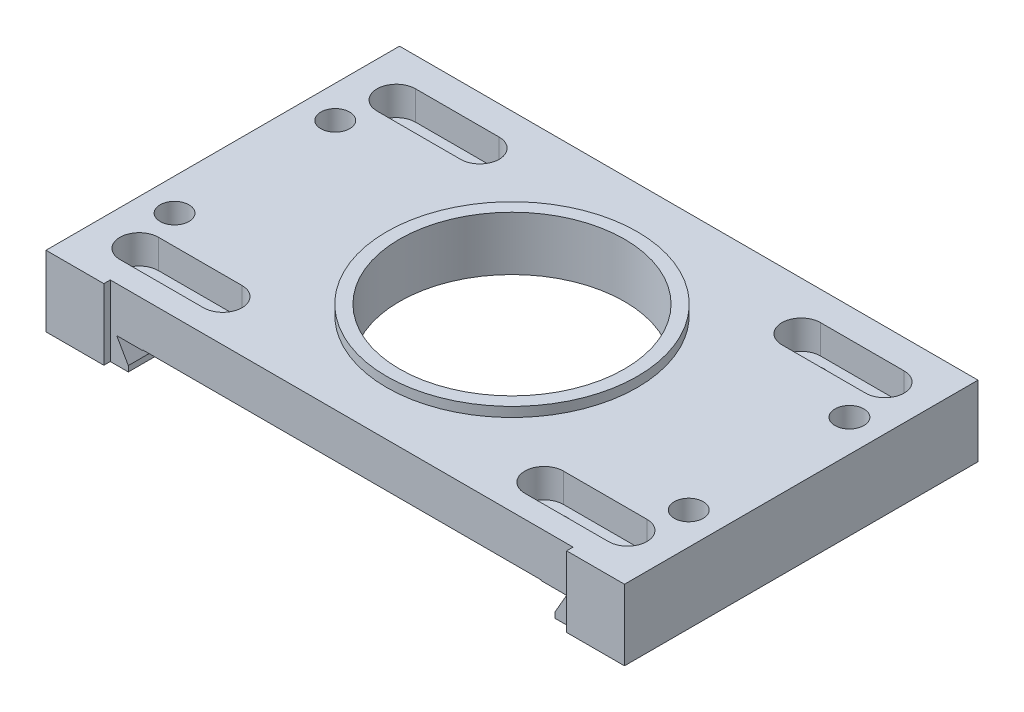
ISO-10303-21;
HEADER;
FILE_DESCRIPTION(('STEP AP214'),'2;1');
FILE_NAME('part.step','',(''),(''),'','','');
FILE_SCHEMA(('AUTOMOTIVE_DESIGN { 1 0 10303 214 1 1 1 1 }'));
ENDSEC;
DATA;
#1=APPLICATION_CONTEXT('core data for automotive mechanical design processes');
#2=APPLICATION_PROTOCOL_DEFINITION('international standard','automotive_design',2000,#1);
#3=PRODUCT_CONTEXT('',#1,'mechanical');
#4=PRODUCT('Part','Part','',(#3));
#5=PRODUCT_RELATED_PRODUCT_CATEGORY('part','',(#4));
#6=PRODUCT_DEFINITION_FORMATION('','',#4);
#7=PRODUCT_DEFINITION_CONTEXT('part definition',#1,'design');
#8=PRODUCT_DEFINITION('design','',#6,#7);
#9=PRODUCT_DEFINITION_SHAPE('','',#8);
#10=(LENGTH_UNIT() NAMED_UNIT(*) SI_UNIT(.MILLI.,.METRE.));
#11=(NAMED_UNIT(*) PLANE_ANGLE_UNIT() SI_UNIT($,.RADIAN.));
#12=(NAMED_UNIT(*) SI_UNIT($,.STERADIAN.) SOLID_ANGLE_UNIT());
#13=UNCERTAINTY_MEASURE_WITH_UNIT(LENGTH_MEASURE(1.E-05),#10,'distance_accuracy_value','');
#14=(GEOMETRIC_REPRESENTATION_CONTEXT(3) GLOBAL_UNCERTAINTY_ASSIGNED_CONTEXT((#13)) GLOBAL_UNIT_ASSIGNED_CONTEXT((#10,
#11,#12)) REPRESENTATION_CONTEXT('',''));
#15=CARTESIAN_POINT('',(0.,0.,0.));
#16=DIRECTION('',(0.,0.,1.));
#17=DIRECTION('',(1.,0.,0.));
#18=AXIS2_PLACEMENT_3D('',#15,#16,#17);
#19=CARTESIAN_POINT('',(35.,-1.5,-27.5));
#20=DIRECTION('',(0.866025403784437,-0.500000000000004,0.));
#21=DIRECTION('',(0.500000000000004,0.866025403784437,0.));
#22=AXIS2_PLACEMENT_3D('',#19,#20,#21);
#23=PLANE('',#22);
#24=DIRECTION('',(0.,0.,1.));
#25=VECTOR('',#24,1.);
#26=CARTESIAN_POINT('',(33.1905989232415,-4.63397459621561,-27.5));
#27=LINE('',#26,#25);
#28=CARTESIAN_POINT('',(33.1905989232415,-4.63397459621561,-27.5));
#29=VERTEX_POINT('',#28);
#30=CARTESIAN_POINT('',(33.1905989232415,-4.63397459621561,-8.49999999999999));
#31=VERTEX_POINT('',#30);
#32=EDGE_CURVE('E377',#29,#31,#27,.T.);
#33=ORIENTED_EDGE('',*,*,#32,.T.);
#34=DIRECTION('',(0.500000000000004,0.866025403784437,0.));
#35=VECTOR('',#34,1.);
#36=CARTESIAN_POINT('',(35.,-1.50000000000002,-8.49999999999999));
#37=LINE('',#36,#35);
#38=CARTESIAN_POINT('',(34.,-3.23205080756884,-8.49999999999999));
#39=VERTEX_POINT('',#38);
#40=EDGE_CURVE('E465',#31,#39,#37,.T.);
#41=ORIENTED_EDGE('',*,*,#40,.T.);
#42=CARTESIAN_POINT('',(34.,-3.23205080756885,-6.49999999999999));
#43=DIRECTION('',(0.866025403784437,-0.500000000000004,0.));
#44=DIRECTION('',(0.500000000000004,0.866025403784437,0.));
#45=AXIS2_PLACEMENT_3D('',#42,#43,#44);
#46=ELLIPSE('',#45,3.99999999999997,2.);
#47=CARTESIAN_POINT('',(35.,-1.5,-8.23205080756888));
#48=VERTEX_POINT('',#47);
#49=EDGE_CURVE('E509',#39,#48,#46,.T.);
#50=ORIENTED_EDGE('',*,*,#49,.T.);
#51=DIRECTION('',(0.,0.,1.));
#52=VECTOR('',#51,1.);
#53=CARTESIAN_POINT('',(35.,-1.5,-27.5));
#54=LINE('',#53,#52);
#55=CARTESIAN_POINT('',(35.,-1.5,-27.5));
#56=VERTEX_POINT('',#55);
#57=EDGE_CURVE('E835',#56,#48,#54,.T.);
#58=ORIENTED_EDGE('',*,*,#57,.F.);
#59=DIRECTION('',(0.500000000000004,0.866025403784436,0.));
#60=VECTOR('',#59,1.);
#61=CARTESIAN_POINT('',(35.,-1.5,-27.5));
#62=LINE('',#61,#60);
#63=EDGE_CURVE('E820',#29,#56,#62,.T.);
#64=ORIENTED_EDGE('',*,*,#63,.F.);
#65=EDGE_LOOP('',(#33,#41,#50,#58,#64));
#66=FACE_BOUND('',#65,.T.);
#67=ADVANCED_FACE('F54',(#66),#23,.F.);
#68=CARTESIAN_POINT('',(45.,-5.5,-27.5));
#69=DIRECTION('',(0.,0.,1.));
#70=DIRECTION('',(1.,0.,0.));
#71=AXIS2_PLACEMENT_3D('',#68,#69,#70);
#72=PLANE('',#71);
#73=DIRECTION('',(0.,-1.,0.));
#74=VECTOR('',#73,1.);
#75=CARTESIAN_POINT('',(33.1905989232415,-4.63397459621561,-27.5));
#76=LINE('',#75,#74);
#77=CARTESIAN_POINT('',(33.1905989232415,-5.5,-27.5));
#78=VERTEX_POINT('',#77);
#79=EDGE_CURVE('E371',#29,#78,#76,.T.);
#80=ORIENTED_EDGE('',*,*,#79,.F.);
#81=ORIENTED_EDGE('',*,*,#63,.T.);
#82=DIRECTION('',(-1.,0.,0.));
#83=VECTOR('',#82,1.);
#84=CARTESIAN_POINT('',(-35.,-1.5,-27.5));
#85=LINE('',#84,#83);
#86=CARTESIAN_POINT('',(31.,-1.5,-27.5));
#87=VERTEX_POINT('',#86);
#88=EDGE_CURVE('E825',#56,#87,#85,.T.);
#89=ORIENTED_EDGE('',*,*,#88,.T.);
#90=DIRECTION('',(0.,-1.,0.));
#91=VECTOR('',#90,1.);
#92=CARTESIAN_POINT('',(31.,-1.4,-27.5));
#93=LINE('',#92,#91);
#94=CARTESIAN_POINT('',(31.,-1.4,-27.5));
#95=VERTEX_POINT('',#94);
#96=EDGE_CURVE('E818',#95,#87,#93,.T.);
#97=ORIENTED_EDGE('',*,*,#96,.F.);
#98=DIRECTION('',(1.,0.,0.));
#99=VECTOR('',#98,1.);
#100=CARTESIAN_POINT('',(-31.,-1.4,-27.5));
#101=LINE('',#100,#99);
#102=CARTESIAN_POINT('',(-31.,-1.4,-27.5));
#103=VERTEX_POINT('',#102);
#104=EDGE_CURVE('E811',#103,#95,#101,.T.);
#105=ORIENTED_EDGE('',*,*,#104,.F.);
#106=DIRECTION('',(0.,-1.,0.));
#107=VECTOR('',#106,1.);
#108=CARTESIAN_POINT('',(-31.,-1.4,-27.5));
#109=LINE('',#108,#107);
#110=CARTESIAN_POINT('',(-31.,-1.5,-27.5));
#111=VERTEX_POINT('',#110);
#112=EDGE_CURVE('E814',#103,#111,#109,.T.);
#113=ORIENTED_EDGE('',*,*,#112,.T.);
#114=CARTESIAN_POINT('',(-35.,-1.5,-27.5));
#115=VERTEX_POINT('',#114);
#116=EDGE_CURVE('E824',#111,#115,#85,.T.);
#117=ORIENTED_EDGE('',*,*,#116,.T.);
#118=DIRECTION('',(0.500000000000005,-0.866025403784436,0.));
#119=VECTOR('',#118,1.);
#120=CARTESIAN_POINT('',(-32.6905989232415,-5.5,-27.5));
#121=LINE('',#120,#119);
#122=CARTESIAN_POINT('',(-33.1905989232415,-4.63397459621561,-27.5));
#123=VERTEX_POINT('',#122);
#124=EDGE_CURVE('E828',#115,#123,#121,.T.);
#125=ORIENTED_EDGE('',*,*,#124,.T.);
#126=DIRECTION('',(0.,-1.,0.));
#127=VECTOR('',#126,1.);
#128=CARTESIAN_POINT('',(-33.1905989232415,-4.63397459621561,-27.5));
#129=LINE('',#128,#127);
#130=CARTESIAN_POINT('',(-33.1905989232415,-5.5,-27.5));
#131=VERTEX_POINT('',#130);
#132=EDGE_CURVE('E858',#123,#131,#129,.T.);
#133=ORIENTED_EDGE('',*,*,#132,.T.);
#134=DIRECTION('',(-1.,0.,0.));
#135=VECTOR('',#134,1.);
#136=CARTESIAN_POINT('',(45.,-5.5,-27.5));
#137=LINE('',#136,#135);
#138=CARTESIAN_POINT('',(-45.,-5.5,-27.5));
#139=VERTEX_POINT('',#138);
#140=EDGE_CURVE('E400',#131,#139,#137,.T.);
#141=ORIENTED_EDGE('',*,*,#140,.T.);
#142=DIRECTION('',(0.,1.,0.));
#143=VECTOR('',#142,1.);
#144=CARTESIAN_POINT('',(-45.,-5.5,-27.5));
#145=LINE('',#144,#143);
#146=CARTESIAN_POINT('',(-45.,5.5,-27.5));
#147=VERTEX_POINT('',#146);
#148=EDGE_CURVE('E833',#139,#147,#145,.T.);
#149=ORIENTED_EDGE('',*,*,#148,.T.);
#150=DIRECTION('',(-1.,0.,0.));
#151=VECTOR('',#150,1.);
#152=CARTESIAN_POINT('',(45.,5.5,-27.5));
#153=LINE('',#152,#151);
#154=CARTESIAN_POINT('',(45.,5.5,-27.5));
#155=VERTEX_POINT('',#154);
#156=EDGE_CURVE('E414',#155,#147,#153,.T.);
#157=ORIENTED_EDGE('',*,*,#156,.F.);
#158=DIRECTION('',(0.,1.,0.));
#159=VECTOR('',#158,1.);
#160=CARTESIAN_POINT('',(45.,-5.5,-27.5));
#161=LINE('',#160,#159);
#162=CARTESIAN_POINT('',(45.,-5.5,-27.5));
#163=VERTEX_POINT('',#162);
#164=EDGE_CURVE('E398',#163,#155,#161,.T.);
#165=ORIENTED_EDGE('',*,*,#164,.F.);
#166=EDGE_CURVE('E389',#163,#78,#137,.T.);
#167=ORIENTED_EDGE('',*,*,#166,.T.);
#168=EDGE_LOOP('',(#80,#81,#89,#97,#105,#113,#117,#125,#133,#141,#149,#157,#165,#167));
#169=FACE_BOUND('',#168,.T.);
#170=ADVANCED_FACE('F395',(#169),#72,.F.);
#171=CARTESIAN_POINT('',(45.,-5.5,27.5));
#172=DIRECTION('',(0.,1.,0.));
#173=DIRECTION('',(0.,0.,1.));
#174=AXIS2_PLACEMENT_3D('',#171,#172,#173);
#175=PLANE('',#174);
#176=CARTESIAN_POINT('',(40.,-5.5,12.5));
#177=DIRECTION('',(0.,-1.,0.));
#178=DIRECTION('',(0.,0.,-1.));
#179=AXIS2_PLACEMENT_3D('',#176,#177,#178);
#180=CIRCLE('',#179,4.);
#181=CARTESIAN_POINT('',(40.,-5.5,8.5));
#182=VERTEX_POINT('',#181);
#183=EDGE_CURVE('E454',#182,#182,#180,.T.);
#184=ORIENTED_EDGE('',*,*,#183,.F.);
#185=EDGE_LOOP('',(#184));
#186=FACE_BOUND('',#185,.T.);
#187=CARTESIAN_POINT('',(40.,-5.5,-12.5));
#188=DIRECTION('',(0.,-1.,0.));
#189=DIRECTION('',(0.,0.,-1.));
#190=AXIS2_PLACEMENT_3D('',#187,#188,#189);
#191=CIRCLE('',#190,4.);
#192=CARTESIAN_POINT('',(40.,-5.5,-16.5));
#193=VERTEX_POINT('',#192);
#194=EDGE_CURVE('E449',#193,#193,#191,.T.);
#195=ORIENTED_EDGE('',*,*,#194,.F.);
#196=EDGE_LOOP('',(#195));
#197=FACE_BOUND('',#196,.T.);
#198=DIRECTION('',(0.,0.,1.));
#199=VECTOR('',#198,1.);
#200=CARTESIAN_POINT('',(33.1905989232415,-5.5,-27.5));
#201=LINE('',#200,#199);
#202=CARTESIAN_POINT('',(33.1905989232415,-5.5,-8.49999999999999));
#203=VERTEX_POINT('',#202);
#204=EDGE_CURVE('E374',#78,#203,#201,.T.);
#205=ORIENTED_EDGE('',*,*,#204,.F.);
#206=ORIENTED_EDGE('',*,*,#166,.F.);
#207=DIRECTION('',(0.,0.,-1.));
#208=VECTOR('',#207,1.);
#209=CARTESIAN_POINT('',(45.,-5.5,27.5));
#210=LINE('',#209,#208);
#211=CARTESIAN_POINT('',(45.,-5.5,27.5));
#212=VERTEX_POINT('',#211);
#213=EDGE_CURVE('E404',#212,#163,#210,.T.);
#214=ORIENTED_EDGE('',*,*,#213,.F.);
#215=DIRECTION('',(-1.,0.,0.));
#216=VECTOR('',#215,1.);
#217=CARTESIAN_POINT('',(45.,-5.5,27.5));
#218=LINE('',#217,#216);
#219=CARTESIAN_POINT('',(36.,-5.5,27.5));
#220=VERTEX_POINT('',#219);
#221=EDGE_CURVE('E402',#212,#220,#218,.T.);
#222=ORIENTED_EDGE('',*,*,#221,.T.);
#223=DIRECTION('',(0.,0.,1.));
#224=VECTOR('',#223,1.);
#225=CARTESIAN_POINT('',(36.,-5.5,26.5));
#226=LINE('',#225,#224);
#227=CARTESIAN_POINT('',(36.,-5.5,26.5));
#228=VERTEX_POINT('',#227);
#229=EDGE_CURVE('E581',#228,#220,#226,.T.);
#230=ORIENTED_EDGE('',*,*,#229,.F.);
#231=DIRECTION('',(1.,0.,0.));
#232=VECTOR('',#231,1.);
#233=CARTESIAN_POINT('',(-36.,-5.5,26.5));
#234=LINE('',#233,#232);
#235=CARTESIAN_POINT('',(33.1905989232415,-5.5,26.5));
#236=VERTEX_POINT('',#235);
#237=EDGE_CURVE('E561',#236,#228,#234,.T.);
#238=ORIENTED_EDGE('',*,*,#237,.F.);
#239=CARTESIAN_POINT('',(33.1905989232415,-5.5,7.50000000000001));
#240=VERTEX_POINT('',#239);
#241=EDGE_CURVE('E381',#240,#236,#201,.T.);
#242=ORIENTED_EDGE('',*,*,#241,.F.);
#243=DIRECTION('',(-1.,0.,0.));
#244=VECTOR('',#243,1.);
#245=CARTESIAN_POINT('',(32.6905989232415,-5.5,7.50000000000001));
#246=LINE('',#245,#244);
#247=CARTESIAN_POINT('',(34.,-5.5,7.50000000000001));
#248=VERTEX_POINT('',#247);
#249=EDGE_CURVE('E875',#248,#240,#246,.T.);
#250=ORIENTED_EDGE('',*,*,#249,.F.);
#251=CARTESIAN_POINT('',(34.,-5.5,5.50000000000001));
#252=DIRECTION('',(0.,1.,0.));
#253=DIRECTION('',(0.,0.,1.));
#254=AXIS2_PLACEMENT_3D('',#251,#252,#253);
#255=CIRCLE('',#254,2.);
#256=CARTESIAN_POINT('',(36.,-5.5,5.50000000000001));
#257=VERTEX_POINT('',#256);
#258=EDGE_CURVE('E503',#248,#257,#255,.T.);
#259=ORIENTED_EDGE('',*,*,#258,.T.);
#260=DIRECTION('',(0.,0.,1.));
#261=VECTOR('',#260,1.);
#262=CARTESIAN_POINT('',(36.,-5.5,7.50000000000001));
#263=LINE('',#262,#261);
#264=CARTESIAN_POINT('',(36.,-5.5,-6.49999999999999));
#265=VERTEX_POINT('',#264);
#266=EDGE_CURVE('E877',#265,#257,#263,.T.);
#267=ORIENTED_EDGE('',*,*,#266,.F.);
#268=CARTESIAN_POINT('',(34.,-5.5,-6.49999999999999));
#269=DIRECTION('',(0.,1.,0.));
#270=DIRECTION('',(0.,0.,1.));
#271=AXIS2_PLACEMENT_3D('',#268,#269,#270);
#272=CIRCLE('',#271,2.);
#273=CARTESIAN_POINT('',(34.,-5.5,-8.49999999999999));
#274=VERTEX_POINT('',#273);
#275=EDGE_CURVE('E507',#265,#274,#272,.T.);
#276=ORIENTED_EDGE('',*,*,#275,.T.);
#277=DIRECTION('',(1.,0.,0.));
#278=VECTOR('',#277,1.);
#279=CARTESIAN_POINT('',(32.6905989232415,-5.5,-8.49999999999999));
#280=LINE('',#279,#278);
#281=EDGE_CURVE('E392',#203,#274,#280,.T.);
#282=ORIENTED_EDGE('',*,*,#281,.F.);
#283=EDGE_LOOP('',(#205,#206,#214,#222,#230,#238,#242,#250,#259,#267,#276,#282));
#284=FACE_BOUND('',#283,.T.);
#285=ADVANCED_FACE('F387',(#186,#197,#284),#175,.F.);
#286=CARTESIAN_POINT('',(33.1905989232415,-4.63397459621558,7.49999999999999));
#287=VERTEX_POINT('',#286);
#288=CARTESIAN_POINT('',(33.1905989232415,-4.63397459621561,26.5));
#289=VERTEX_POINT('',#288);
#290=EDGE_CURVE('E393',#287,#289,#27,.T.);
#291=ORIENTED_EDGE('',*,*,#290,.T.);
#292=DIRECTION('',(0.500000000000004,0.866025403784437,0.));
#293=VECTOR('',#292,1.);
#294=CARTESIAN_POINT('',(35.,-1.5,26.5));
#295=LINE('',#294,#293);
#296=CARTESIAN_POINT('',(35.,-1.5,26.5));
#297=VERTEX_POINT('',#296);
#298=EDGE_CURVE('E599',#289,#297,#295,.T.);
#299=ORIENTED_EDGE('',*,*,#298,.T.);
#300=CARTESIAN_POINT('',(35.,-1.5,7.23205080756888));
#301=VERTEX_POINT('',#300);
#302=EDGE_CURVE('E831',#301,#297,#54,.T.);
#303=ORIENTED_EDGE('',*,*,#302,.F.);
#304=CARTESIAN_POINT('',(34.,-3.23205080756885,5.50000000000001));
#305=DIRECTION('',(0.866025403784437,-0.500000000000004,0.));
#306=DIRECTION('',(0.500000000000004,0.866025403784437,0.));
#307=AXIS2_PLACEMENT_3D('',#304,#305,#306);
#308=ELLIPSE('',#307,3.99999999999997,2.);
#309=CARTESIAN_POINT('',(34.,-3.23205080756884,7.49999999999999));
#310=VERTEX_POINT('',#309);
#311=EDGE_CURVE('E505',#301,#310,#308,.T.);
#312=ORIENTED_EDGE('',*,*,#311,.T.);
#313=DIRECTION('',(-0.500000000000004,-0.866025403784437,0.));
#314=VECTOR('',#313,1.);
#315=CARTESIAN_POINT('',(35.,-1.50000000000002,7.50000000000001));
#316=LINE('',#315,#314);
#317=EDGE_CURVE('E463',#310,#287,#316,.T.);
#318=ORIENTED_EDGE('',*,*,#317,.T.);
#319=EDGE_LOOP('',(#291,#299,#303,#312,#318));
#320=FACE_BOUND('',#319,.T.);
#321=ADVANCED_FACE('F897',(#320),#23,.F.);
#322=CARTESIAN_POINT('',(0.,0.,26.5));
#323=DIRECTION('',(0.,0.,-1.));
#324=DIRECTION('',(-1.,0.,0.));
#325=AXIS2_PLACEMENT_3D('',#322,#323,#324);
#326=PLANE('',#325);
#327=DIRECTION('',(0.,-1.,0.));
#328=VECTOR('',#327,1.);
#329=CARTESIAN_POINT('',(33.1905989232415,-4.63397459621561,26.5));
#330=LINE('',#329,#328);
#331=EDGE_CURVE('E382',#289,#236,#330,.T.);
#332=ORIENTED_EDGE('',*,*,#331,.T.);
#333=ORIENTED_EDGE('',*,*,#237,.T.);
#334=DIRECTION('',(0.,1.,0.));
#335=VECTOR('',#334,1.);
#336=CARTESIAN_POINT('',(36.,-5.5,26.5));
#337=LINE('',#336,#335);
#338=CARTESIAN_POINT('',(36.,5.5,26.5));
#339=VERTEX_POINT('',#338);
#340=EDGE_CURVE('E566',#228,#339,#337,.T.);
#341=ORIENTED_EDGE('',*,*,#340,.T.);
#342=DIRECTION('',(-1.,0.,0.));
#343=VECTOR('',#342,1.);
#344=CARTESIAN_POINT('',(-36.,5.5,26.5));
#345=LINE('',#344,#343);
#346=CARTESIAN_POINT('',(-36.,5.5,26.5));
#347=VERTEX_POINT('',#346);
#348=EDGE_CURVE('E569',#339,#347,#345,.T.);
#349=ORIENTED_EDGE('',*,*,#348,.T.);
#350=DIRECTION('',(0.,-1.,0.));
#351=VECTOR('',#350,1.);
#352=CARTESIAN_POINT('',(-36.,-5.5,26.5));
#353=LINE('',#352,#351);
#354=CARTESIAN_POINT('',(-36.,-5.5,26.5));
#355=VERTEX_POINT('',#354);
#356=EDGE_CURVE('E558',#347,#355,#353,.T.);
#357=ORIENTED_EDGE('',*,*,#356,.T.);
#358=CARTESIAN_POINT('',(-33.1905989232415,-5.5,26.5));
#359=VERTEX_POINT('',#358);
#360=EDGE_CURVE('E563',#355,#359,#234,.T.);
#361=ORIENTED_EDGE('',*,*,#360,.T.);
#362=DIRECTION('',(0.,-1.,0.));
#363=VECTOR('',#362,1.);
#364=CARTESIAN_POINT('',(-33.1905989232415,-4.63397459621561,26.5));
#365=LINE('',#364,#363);
#366=CARTESIAN_POINT('',(-33.1905989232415,-4.63397459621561,26.5));
#367=VERTEX_POINT('',#366);
#368=EDGE_CURVE('E861',#367,#359,#365,.T.);
#369=ORIENTED_EDGE('',*,*,#368,.F.);
#370=DIRECTION('',(0.500000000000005,-0.866025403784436,0.));
#371=VECTOR('',#370,1.);
#372=CARTESIAN_POINT('',(-32.6905989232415,-5.5,26.5));
#373=LINE('',#372,#371);
#374=CARTESIAN_POINT('',(-35.,-1.5,26.5));
#375=VERTEX_POINT('',#374);
#376=EDGE_CURVE('E593',#375,#367,#373,.T.);
#377=ORIENTED_EDGE('',*,*,#376,.F.);
#378=DIRECTION('',(-1.,0.,0.));
#379=VECTOR('',#378,1.);
#380=CARTESIAN_POINT('',(-35.,-1.5,26.5));
#381=LINE('',#380,#379);
#382=CARTESIAN_POINT('',(-31.,-1.5,26.5));
#383=VERTEX_POINT('',#382);
#384=EDGE_CURVE('E590',#383,#375,#381,.T.);
#385=ORIENTED_EDGE('',*,*,#384,.F.);
#386=DIRECTION('',(0.,-1.,0.));
#387=VECTOR('',#386,1.);
#388=CARTESIAN_POINT('',(-31.,-1.4,26.5));
#389=LINE('',#388,#387);
#390=CARTESIAN_POINT('',(-31.,-1.4,26.5));
#391=VERTEX_POINT('',#390);
#392=EDGE_CURVE('E577',#391,#383,#389,.T.);
#393=ORIENTED_EDGE('',*,*,#392,.F.);
#394=DIRECTION('',(-1.,0.,0.));
#395=VECTOR('',#394,1.);
#396=CARTESIAN_POINT('',(0.,-1.4,26.5));
#397=LINE('',#396,#395);
#398=CARTESIAN_POINT('',(31.,-1.4,26.5));
#399=VERTEX_POINT('',#398);
#400=EDGE_CURVE('E420',#399,#391,#397,.T.);
#401=ORIENTED_EDGE('',*,*,#400,.F.);
#402=DIRECTION('',(0.,1.,0.));
#403=VECTOR('',#402,1.);
#404=CARTESIAN_POINT('',(31.,-1.4,26.5));
#405=LINE('',#404,#403);
#406=CARTESIAN_POINT('',(31.,-1.5,26.5));
#407=VERTEX_POINT('',#406);
#408=EDGE_CURVE('E587',#407,#399,#405,.T.);
#409=ORIENTED_EDGE('',*,*,#408,.F.);
#410=DIRECTION('',(-1.,0.,0.));
#411=VECTOR('',#410,1.);
#412=CARTESIAN_POINT('',(-35.,-1.5,26.5));
#413=LINE('',#412,#411);
#414=EDGE_CURVE('E596',#297,#407,#413,.T.);
#415=ORIENTED_EDGE('',*,*,#414,.F.);
#416=ORIENTED_EDGE('',*,*,#298,.F.);
#417=EDGE_LOOP('',(#332,#333,#341,#349,#357,#361,#369,#377,#385,#393,#401,#409,#415,#416));
#418=FACE_BOUND('',#417,.T.);
#419=ADVANCED_FACE('F913',(#418),#326,.F.);
#420=CARTESIAN_POINT('',(32.6905989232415,14.8386699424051,-8.49999999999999));
#421=DIRECTION('',(0.,0.,-1.));
#422=DIRECTION('',(-1.,0.,0.));
#423=AXIS2_PLACEMENT_3D('',#420,#421,#422);
#424=PLANE('',#423);
#425=ORIENTED_EDGE('',*,*,#281,.T.);
#426=DIRECTION('',(0.,-1.,0.));
#427=VECTOR('',#426,1.);
#428=CARTESIAN_POINT('',(34.,-1.5,-8.49999999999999));
#429=LINE('',#428,#427);
#430=EDGE_CURVE('E487',#274,#39,#429,.F.);
#431=ORIENTED_EDGE('',*,*,#430,.T.);
#432=ORIENTED_EDGE('',*,*,#40,.F.);
#433=DIRECTION('',(0.,1.,0.));
#434=VECTOR('',#433,1.);
#435=CARTESIAN_POINT('',(33.1905989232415,14.8386699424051,-8.49999999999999));
#436=LINE('',#435,#434);
#437=EDGE_CURVE('E865',#203,#31,#436,.T.);
#438=ORIENTED_EDGE('',*,*,#437,.F.);
#439=EDGE_LOOP('',(#425,#431,#432,#438));
#440=FACE_BOUND('',#439,.T.);
#441=ADVANCED_FACE('F936',(#440),#424,.F.);
#442=CARTESIAN_POINT('',(32.6905989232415,14.8386699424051,7.50000000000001));
#443=DIRECTION('',(0.,0.,1.));
#444=DIRECTION('',(1.,0.,0.));
#445=AXIS2_PLACEMENT_3D('',#442,#443,#444);
#446=PLANE('',#445);
#447=ORIENTED_EDGE('',*,*,#317,.F.);
#448=DIRECTION('',(0.,-1.,0.));
#449=VECTOR('',#448,1.);
#450=CARTESIAN_POINT('',(34.,-5.5,7.50000000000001));
#451=LINE('',#450,#449);
#452=EDGE_CURVE('E474',#310,#248,#451,.T.);
#453=ORIENTED_EDGE('',*,*,#452,.T.);
#454=ORIENTED_EDGE('',*,*,#249,.T.);
#455=DIRECTION('',(0.,-1.,0.));
#456=VECTOR('',#455,1.);
#457=CARTESIAN_POINT('',(33.1905989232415,14.8386699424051,7.50000000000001));
#458=LINE('',#457,#456);
#459=EDGE_CURVE('E471',#287,#240,#458,.T.);
#460=ORIENTED_EDGE('',*,*,#459,.F.);
#461=EDGE_LOOP('',(#447,#453,#454,#460));
#462=FACE_BOUND('',#461,.T.);
#463=ADVANCED_FACE('F901',(#462),#446,.F.);
#464=CARTESIAN_POINT('',(-32.6905989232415,-5.5,-27.5));
#465=DIRECTION('',(-0.866025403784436,-0.500000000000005,0.));
#466=DIRECTION('',(0.500000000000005,-0.866025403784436,0.));
#467=AXIS2_PLACEMENT_3D('',#464,#465,#466);
#468=PLANE('',#467);
#469=ORIENTED_EDGE('',*,*,#376,.T.);
#470=DIRECTION('',(0.,0.,1.));
#471=VECTOR('',#470,1.);
#472=CARTESIAN_POINT('',(-33.1905989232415,-4.63397459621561,-27.5));
#473=LINE('',#472,#471);
#474=CARTESIAN_POINT('',(-33.1905989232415,-4.63397459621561,7.49999999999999));
#475=VERTEX_POINT('',#474);
#476=EDGE_CURVE('E860',#475,#367,#473,.T.);
#477=ORIENTED_EDGE('',*,*,#476,.F.);
#478=DIRECTION('',(-0.500000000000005,0.866025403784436,0.));
#479=VECTOR('',#478,1.);
#480=CARTESIAN_POINT('',(-32.6905989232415,-5.50000000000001,7.49999999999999));
#481=LINE('',#480,#479);
#482=CARTESIAN_POINT('',(-34.,-3.23205080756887,7.49999999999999));
#483=VERTEX_POINT('',#482);
#484=EDGE_CURVE('E532',#475,#483,#481,.T.);
#485=ORIENTED_EDGE('',*,*,#484,.T.);
#486=CARTESIAN_POINT('',(-34.,-3.23205080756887,5.49999999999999));
#487=DIRECTION('',(-0.866025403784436,-0.500000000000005,0.));
#488=DIRECTION('',(-0.500000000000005,0.866025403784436,0.));
#489=AXIS2_PLACEMENT_3D('',#486,#487,#488);
#490=ELLIPSE('',#489,3.99999999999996,2.);
#491=CARTESIAN_POINT('',(-35.,-1.5,7.23205080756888));
#492=VERTEX_POINT('',#491);
#493=EDGE_CURVE('E13',#483,#492,#490,.T.);
#494=ORIENTED_EDGE('',*,*,#493,.T.);
#495=DIRECTION('',(0.,0.,1.));
#496=VECTOR('',#495,1.);
#497=CARTESIAN_POINT('',(-35.,-1.5,-27.5));
#498=LINE('',#497,#496);
#499=EDGE_CURVE('E834',#492,#375,#498,.T.);
#500=ORIENTED_EDGE('',*,*,#499,.T.);
#501=EDGE_LOOP('',(#469,#477,#485,#494,#500));
#502=FACE_BOUND('',#501,.T.);
#503=ADVANCED_FACE('F943',(#502),#468,.F.);
#504=CARTESIAN_POINT('',(45.,-5.5,27.5));
#505=DIRECTION('',(0.,0.,-1.));
#506=DIRECTION('',(-1.,0.,0.));
#507=AXIS2_PLACEMENT_3D('',#504,#505,#506);
#508=PLANE('',#507);
#509=CARTESIAN_POINT('',(-36.,-5.5,27.5));
#510=VERTEX_POINT('',#509);
#511=CARTESIAN_POINT('',(-45.,-5.5,27.5));
#512=VERTEX_POINT('',#511);
#513=EDGE_CURVE('E399',#510,#512,#218,.T.);
#514=ORIENTED_EDGE('',*,*,#513,.F.);
#515=DIRECTION('',(0.,-1.,0.));
#516=VECTOR('',#515,1.);
#517=CARTESIAN_POINT('',(-36.,-5.5,27.5));
#518=LINE('',#517,#516);
#519=CARTESIAN_POINT('',(-36.,5.5,27.5));
#520=VERTEX_POINT('',#519);
#521=EDGE_CURVE('E557',#520,#510,#518,.T.);
#522=ORIENTED_EDGE('',*,*,#521,.F.);
#523=DIRECTION('',(-1.,0.,0.));
#524=VECTOR('',#523,1.);
#525=CARTESIAN_POINT('',(45.,5.5,27.5));
#526=LINE('',#525,#524);
#527=CARTESIAN_POINT('',(-45.,5.5,27.5));
#528=VERTEX_POINT('',#527);
#529=EDGE_CURVE('E410',#520,#528,#526,.T.);
#530=ORIENTED_EDGE('',*,*,#529,.T.);
#531=DIRECTION('',(0.,-1.,0.));
#532=VECTOR('',#531,1.);
#533=CARTESIAN_POINT('',(-45.,-5.5,27.5));
#534=LINE('',#533,#532);
#535=EDGE_CURVE('E847',#528,#512,#534,.T.);
#536=ORIENTED_EDGE('',*,*,#535,.T.);
#537=EDGE_LOOP('',(#514,#522,#530,#536));
#538=FACE_BOUND('',#537,.T.);
#539=ADVANCED_FACE('F977',(#538),#508,.F.);
#540=CARTESIAN_POINT('',(45.,5.5,27.5));
#541=DIRECTION('',(0.,-1.,0.));
#542=DIRECTION('',(0.,0.,-1.));
#543=AXIS2_PLACEMENT_3D('',#540,#541,#542);
#544=PLANE('',#543);
#545=ORIENTED_EDGE('',*,*,#529,.F.);
#546=DIRECTION('',(0.,0.,1.));
#547=VECTOR('',#546,1.);
#548=CARTESIAN_POINT('',(-36.,5.5,26.5));
#549=LINE('',#548,#547);
#550=EDGE_CURVE('E575',#347,#520,#549,.T.);
#551=ORIENTED_EDGE('',*,*,#550,.F.);
#552=ORIENTED_EDGE('',*,*,#348,.F.);
#553=DIRECTION('',(0.,0.,1.));
#554=VECTOR('',#553,1.);
#555=CARTESIAN_POINT('',(36.,5.5,26.5));
#556=LINE('',#555,#554);
#557=CARTESIAN_POINT('',(36.,5.5,27.5));
#558=VERTEX_POINT('',#557);
#559=EDGE_CURVE('E578',#339,#558,#556,.T.);
#560=ORIENTED_EDGE('',*,*,#559,.T.);
#561=CARTESIAN_POINT('',(45.,5.5,27.5));
#562=VERTEX_POINT('',#561);
#563=EDGE_CURVE('E411',#562,#558,#526,.T.);
#564=ORIENTED_EDGE('',*,*,#563,.F.);
#565=DIRECTION('',(0.,0.,1.));
#566=VECTOR('',#565,1.);
#567=CARTESIAN_POINT('',(45.,5.5,27.5));
#568=LINE('',#567,#566);
#569=EDGE_CURVE('E838',#155,#562,#568,.T.);
#570=ORIENTED_EDGE('',*,*,#569,.F.);
#571=ORIENTED_EDGE('',*,*,#156,.T.);
#572=DIRECTION('',(0.,0.,1.));
#573=VECTOR('',#572,1.);
#574=CARTESIAN_POINT('',(-45.,5.5,27.5));
#575=LINE('',#574,#573);
#576=EDGE_CURVE('E845',#147,#528,#575,.T.);
#577=ORIENTED_EDGE('',*,*,#576,.T.);
#578=EDGE_LOOP('',(#545,#551,#552,#560,#564,#570,#571,#577));
#579=FACE_BOUND('',#578,.T.);
#580=CARTESIAN_POINT('',(-40.,5.5,12.5));
#581=DIRECTION('',(0.,-1.,0.));
#582=DIRECTION('',(0.,0.,-1.));
#583=AXIS2_PLACEMENT_3D('',#580,#581,#582);
#584=CIRCLE('',#583,2.25);
#585=CARTESIAN_POINT('',(-40.,5.5,10.25));
#586=VERTEX_POINT('',#585);
#587=EDGE_CURVE('E456',#586,#586,#584,.T.);
#588=ORIENTED_EDGE('',*,*,#587,.T.);
#589=EDGE_LOOP('',(#588));
#590=FACE_BOUND('',#589,.T.);
#591=CARTESIAN_POINT('',(-40.,5.5,-12.5));
#592=DIRECTION('',(0.,-1.,0.));
#593=DIRECTION('',(0.,0.,-1.));
#594=AXIS2_PLACEMENT_3D('',#591,#592,#593);
#595=CIRCLE('',#594,2.25);
#596=CARTESIAN_POINT('',(-40.,5.5,-14.75));
#597=VERTEX_POINT('',#596);
#598=EDGE_CURVE('E451',#597,#597,#595,.T.);
#599=ORIENTED_EDGE('',*,*,#598,.T.);
#600=EDGE_LOOP('',(#599));
#601=FACE_BOUND('',#600,.T.);
#602=CARTESIAN_POINT('',(40.,5.5,12.5));
#603=DIRECTION('',(0.,-1.,0.));
#604=DIRECTION('',(0.,0.,-1.));
#605=AXIS2_PLACEMENT_3D('',#602,#603,#604);
#606=CIRCLE('',#605,2.25);
#607=CARTESIAN_POINT('',(40.,5.5,10.25));
#608=VERTEX_POINT('',#607);
#609=EDGE_CURVE('E446',#608,#608,#606,.T.);
#610=ORIENTED_EDGE('',*,*,#609,.T.);
#611=EDGE_LOOP('',(#610));
#612=FACE_BOUND('',#611,.T.);
#613=CARTESIAN_POINT('',(40.,5.5,-12.5));
#614=DIRECTION('',(0.,-1.,0.));
#615=DIRECTION('',(0.,0.,-1.));
#616=AXIS2_PLACEMENT_3D('',#613,#614,#615);
#617=CIRCLE('',#616,2.25);
#618=CARTESIAN_POINT('',(40.,5.5,-14.75));
#619=VERTEX_POINT('',#618);
#620=EDGE_CURVE('E441',#619,#619,#617,.T.);
#621=ORIENTED_EDGE('',*,*,#620,.T.);
#622=EDGE_LOOP('',(#621));
#623=FACE_BOUND('',#622,.T.);
#624=DIRECTION('',(1.,0.,0.));
#625=VECTOR('',#624,1.);
#626=CARTESIAN_POINT('',(25.,5.5,23.));
#627=LINE('',#626,#625);
#628=CARTESIAN_POINT('',(25.,5.5,23.));
#629=VERTEX_POINT('',#628);
#630=CARTESIAN_POINT('',(38.,5.5,23.));
#631=VERTEX_POINT('',#630);
#632=EDGE_CURVE('E659',#629,#631,#627,.T.);
#633=ORIENTED_EDGE('',*,*,#632,.F.);
#634=CARTESIAN_POINT('',(25.,5.5,20.));
#635=DIRECTION('',(0.,1.,0.));
#636=DIRECTION('',(0.,0.,-1.));
#637=AXIS2_PLACEMENT_3D('',#634,#635,#636);
#638=CIRCLE('',#637,3.);
#639=CARTESIAN_POINT('',(25.,5.5,17.));
#640=VERTEX_POINT('',#639);
#641=EDGE_CURVE('E643',#640,#629,#638,.T.);
#642=ORIENTED_EDGE('',*,*,#641,.F.);
#643=DIRECTION('',(-1.,0.,0.));
#644=VECTOR('',#643,1.);
#645=CARTESIAN_POINT('',(25.,5.5,17.));
#646=LINE('',#645,#644);
#647=CARTESIAN_POINT('',(38.,5.5,17.));
#648=VERTEX_POINT('',#647);
#649=EDGE_CURVE('E648',#648,#640,#646,.T.);
#650=ORIENTED_EDGE('',*,*,#649,.F.);
#651=CARTESIAN_POINT('',(38.,5.5,20.));
#652=DIRECTION('',(0.,1.,0.));
#653=DIRECTION('',(0.,0.,-1.));
#654=AXIS2_PLACEMENT_3D('',#651,#652,#653);
#655=CIRCLE('',#654,3.);
#656=EDGE_CURVE('E662',#631,#648,#655,.T.);
#657=ORIENTED_EDGE('',*,*,#656,.F.);
#658=EDGE_LOOP('',(#633,#642,#650,#657));
#659=FACE_BOUND('',#658,.T.);
#660=CARTESIAN_POINT('',(-25.,5.5,20.));
#661=DIRECTION('',(0.,-1.,0.));
#662=DIRECTION('',(0.,0.,-1.));
#663=AXIS2_PLACEMENT_3D('',#660,#661,#662);
#664=CIRCLE('',#663,3.);
#665=CARTESIAN_POINT('',(-25.,5.5,17.));
#666=VERTEX_POINT('',#665);
#667=CARTESIAN_POINT('',(-25.,5.5,23.));
#668=VERTEX_POINT('',#667);
#669=EDGE_CURVE('E722',#666,#668,#664,.T.);
#670=ORIENTED_EDGE('',*,*,#669,.T.);
#671=DIRECTION('',(-1.,0.,0.));
#672=VECTOR('',#671,1.);
#673=CARTESIAN_POINT('',(-25.,5.5,23.));
#674=LINE('',#673,#672);
#675=CARTESIAN_POINT('',(-38.,5.5,23.));
#676=VERTEX_POINT('',#675);
#677=EDGE_CURVE('E727',#668,#676,#674,.T.);
#678=ORIENTED_EDGE('',*,*,#677,.T.);
#679=CARTESIAN_POINT('',(-38.,5.5,20.));
#680=DIRECTION('',(0.,-1.,0.));
#681=DIRECTION('',(0.,0.,-1.));
#682=AXIS2_PLACEMENT_3D('',#679,#680,#681);
#683=CIRCLE('',#682,3.);
#684=CARTESIAN_POINT('',(-38.,5.5,17.));
#685=VERTEX_POINT('',#684);
#686=EDGE_CURVE('E739',#676,#685,#683,.T.);
#687=ORIENTED_EDGE('',*,*,#686,.T.);
#688=DIRECTION('',(1.,0.,0.));
#689=VECTOR('',#688,1.);
#690=CARTESIAN_POINT('',(-25.,5.5,17.));
#691=LINE('',#690,#689);
#692=EDGE_CURVE('E736',#685,#666,#691,.T.);
#693=ORIENTED_EDGE('',*,*,#692,.T.);
#694=EDGE_LOOP('',(#670,#678,#687,#693));
#695=FACE_BOUND('',#694,.T.);
#696=DIRECTION('',(-1.,0.,0.));
#697=VECTOR('',#696,1.);
#698=CARTESIAN_POINT('',(-25.,5.5,-23.));
#699=LINE('',#698,#697);
#700=CARTESIAN_POINT('',(-25.,5.5,-23.));
#701=VERTEX_POINT('',#700);
#702=CARTESIAN_POINT('',(-38.,5.5,-23.));
#703=VERTEX_POINT('',#702);
#704=EDGE_CURVE('E779',#701,#703,#699,.T.);
#705=ORIENTED_EDGE('',*,*,#704,.F.);
#706=CARTESIAN_POINT('',(-25.,5.5,-20.));
#707=DIRECTION('',(0.,1.,0.));
#708=DIRECTION('',(0.,0.,1.));
#709=AXIS2_PLACEMENT_3D('',#706,#707,#708);
#710=CIRCLE('',#709,3.);
#711=CARTESIAN_POINT('',(-25.,5.5,-17.));
#712=VERTEX_POINT('',#711);
#713=EDGE_CURVE('E763',#712,#701,#710,.T.);
#714=ORIENTED_EDGE('',*,*,#713,.F.);
#715=DIRECTION('',(1.,0.,0.));
#716=VECTOR('',#715,1.);
#717=CARTESIAN_POINT('',(-25.,5.5,-17.));
#718=LINE('',#717,#716);
#719=CARTESIAN_POINT('',(-38.,5.5,-17.));
#720=VERTEX_POINT('',#719);
#721=EDGE_CURVE('E768',#720,#712,#718,.T.);
#722=ORIENTED_EDGE('',*,*,#721,.F.);
#723=CARTESIAN_POINT('',(-38.,5.5,-20.));
#724=DIRECTION('',(0.,1.,0.));
#725=DIRECTION('',(0.,0.,1.));
#726=AXIS2_PLACEMENT_3D('',#723,#724,#725);
#727=CIRCLE('',#726,3.);
#728=EDGE_CURVE('E782',#703,#720,#727,.T.);
#729=ORIENTED_EDGE('',*,*,#728,.F.);
#730=EDGE_LOOP('',(#705,#714,#722,#729));
#731=FACE_BOUND('',#730,.T.);
#732=CARTESIAN_POINT('',(0.,5.5,0.));
#733=DIRECTION('',(0.,-1.,0.));
#734=DIRECTION('',(0.,0.,-1.));
#735=AXIS2_PLACEMENT_3D('',#732,#733,#734);
#736=CIRCLE('',#735,19.5);
#737=CARTESIAN_POINT('',(0.,5.5,-19.5));
#738=VERTEX_POINT('',#737);
#739=EDGE_CURVE('E417',#738,#738,#736,.F.);
#740=ORIENTED_EDGE('',*,*,#739,.F.);
#741=EDGE_LOOP('',(#740));
#742=FACE_BOUND('',#741,.T.);
#743=CARTESIAN_POINT('',(25.,5.5,-20.));
#744=DIRECTION('',(0.,-1.,0.));
#745=DIRECTION('',(0.,0.,1.));
#746=AXIS2_PLACEMENT_3D('',#743,#744,#745);
#747=CIRCLE('',#746,3.);
#748=CARTESIAN_POINT('',(25.,5.5,-17.));
#749=VERTEX_POINT('',#748);
#750=CARTESIAN_POINT('',(25.,5.5,-23.));
#751=VERTEX_POINT('',#750);
#752=EDGE_CURVE('E681',#749,#751,#747,.T.);
#753=ORIENTED_EDGE('',*,*,#752,.T.);
#754=DIRECTION('',(1.,0.,0.));
#755=VECTOR('',#754,1.);
#756=CARTESIAN_POINT('',(25.,5.5,-23.));
#757=LINE('',#756,#755);
#758=CARTESIAN_POINT('',(38.,5.5,-23.));
#759=VERTEX_POINT('',#758);
#760=EDGE_CURVE('E686',#751,#759,#757,.T.);
#761=ORIENTED_EDGE('',*,*,#760,.T.);
#762=CARTESIAN_POINT('',(38.,5.5,-20.));
#763=DIRECTION('',(0.,-1.,0.));
#764=DIRECTION('',(0.,0.,1.));
#765=AXIS2_PLACEMENT_3D('',#762,#763,#764);
#766=CIRCLE('',#765,3.);
#767=CARTESIAN_POINT('',(38.,5.5,-17.));
#768=VERTEX_POINT('',#767);
#769=EDGE_CURVE('E698',#759,#768,#766,.T.);
#770=ORIENTED_EDGE('',*,*,#769,.T.);
#771=DIRECTION('',(-1.,0.,0.));
#772=VECTOR('',#771,1.);
#773=CARTESIAN_POINT('',(25.,5.5,-17.));
#774=LINE('',#773,#772);
#775=EDGE_CURVE('E695',#768,#749,#774,.T.);
#776=ORIENTED_EDGE('',*,*,#775,.T.);
#777=EDGE_LOOP('',(#753,#761,#770,#776));
#778=FACE_BOUND('',#777,.T.);
#779=ADVANCED_FACE('F978',(#579,#590,#601,#612,#623,#659,#695,#731,#742,#778),#544,.F.);
#780=CARTESIAN_POINT('',(-35.,-1.5,-27.5));
#781=DIRECTION('',(0.,1.,0.));
#782=DIRECTION('',(-1.,0.,0.));
#783=AXIS2_PLACEMENT_3D('',#780,#781,#782);
#784=PLANE('',#783);
#785=CARTESIAN_POINT('',(34.,-1.5,5.50000000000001));
#786=DIRECTION('',(0.,1.,0.));
#787=DIRECTION('',(-1.,0.,0.));
#788=AXIS2_PLACEMENT_3D('',#785,#786,#787);
#789=CIRCLE('',#788,2.);
#790=CARTESIAN_POINT('',(36.,-1.5,5.50000000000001));
#791=VERTEX_POINT('',#790);
#792=EDGE_CURVE('E484',#791,#301,#789,.F.);
#793=ORIENTED_EDGE('',*,*,#792,.T.);
#794=ORIENTED_EDGE('',*,*,#302,.T.);
#795=ORIENTED_EDGE('',*,*,#414,.T.);
#796=DIRECTION('',(0.,0.,1.));
#797=VECTOR('',#796,1.);
#798=CARTESIAN_POINT('',(31.,-1.5,-27.5));
#799=LINE('',#798,#797);
#800=EDGE_CURVE('E804',#87,#407,#799,.T.);
#801=ORIENTED_EDGE('',*,*,#800,.F.);
#802=ORIENTED_EDGE('',*,*,#88,.F.);
#803=ORIENTED_EDGE('',*,*,#57,.T.);
#804=CARTESIAN_POINT('',(34.,-1.5,-6.49999999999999));
#805=DIRECTION('',(0.,1.,0.));
#806=DIRECTION('',(-1.,0.,0.));
#807=AXIS2_PLACEMENT_3D('',#804,#805,#806);
#808=CIRCLE('',#807,2.);
#809=CARTESIAN_POINT('',(36.,-1.5,-6.49999999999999));
#810=VERTEX_POINT('',#809);
#811=EDGE_CURVE('E482',#48,#810,#808,.F.);
#812=ORIENTED_EDGE('',*,*,#811,.T.);
#813=DIRECTION('',(0.,0.,1.));
#814=VECTOR('',#813,1.);
#815=CARTESIAN_POINT('',(36.,-1.5,7.50000000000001));
#816=LINE('',#815,#814);
#817=EDGE_CURVE('E551',#810,#791,#816,.T.);
#818=ORIENTED_EDGE('',*,*,#817,.T.);
#819=EDGE_LOOP('',(#793,#794,#795,#801,#802,#803,#812,#818));
#820=FACE_BOUND('',#819,.T.);
#821=ADVANCED_FACE('F884',(#820),#784,.F.);
#822=CARTESIAN_POINT('',(-40.,-5.5,12.5));
#823=DIRECTION('',(0.,-1.,0.));
#824=DIRECTION('',(0.,0.,-1.));
#825=AXIS2_PLACEMENT_3D('',#822,#823,#824);
#826=CIRCLE('',#825,4.);
#827=CARTESIAN_POINT('',(-40.,-5.5,8.5));
#828=VERTEX_POINT('',#827);
#829=EDGE_CURVE('E601',#828,#828,#826,.T.);
#830=ORIENTED_EDGE('',*,*,#829,.F.);
#831=EDGE_LOOP('',(#830));
#832=FACE_BOUND('',#831,.T.);
#833=CARTESIAN_POINT('',(-40.,-5.5,-12.5));
#834=DIRECTION('',(0.,-1.,0.));
#835=DIRECTION('',(0.,0.,-1.));
#836=AXIS2_PLACEMENT_3D('',#833,#834,#835);
#837=CIRCLE('',#836,4.);
#838=CARTESIAN_POINT('',(-40.,-5.5,-16.5));
#839=VERTEX_POINT('',#838);
#840=EDGE_CURVE('E459',#839,#839,#837,.T.);
#841=ORIENTED_EDGE('',*,*,#840,.F.);
#842=EDGE_LOOP('',(#841));
#843=FACE_BOUND('',#842,.T.);
#844=ORIENTED_EDGE('',*,*,#140,.F.);
#845=DIRECTION('',(0.,0.,1.));
#846=VECTOR('',#845,1.);
#847=CARTESIAN_POINT('',(-33.1905989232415,-5.5,-27.5));
#848=LINE('',#847,#846);
#849=CARTESIAN_POINT('',(-33.1905989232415,-5.5,-8.50000000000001));
#850=VERTEX_POINT('',#849);
#851=EDGE_CURVE('E869',#131,#850,#848,.T.);
#852=ORIENTED_EDGE('',*,*,#851,.T.);
#853=DIRECTION('',(1.,0.,0.));
#854=VECTOR('',#853,1.);
#855=CARTESIAN_POINT('',(-32.6905989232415,-5.5,-8.50000000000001));
#856=LINE('',#855,#854);
#857=CARTESIAN_POINT('',(-34.,-5.5,-8.50000000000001));
#858=VERTEX_POINT('',#857);
#859=EDGE_CURVE('E542',#858,#850,#856,.T.);
#860=ORIENTED_EDGE('',*,*,#859,.F.);
#861=CARTESIAN_POINT('',(-34.,-5.5,-6.50000000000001));
#862=DIRECTION('',(0.,1.,0.));
#863=DIRECTION('',(0.,0.,1.));
#864=AXIS2_PLACEMENT_3D('',#861,#862,#863);
#865=CIRCLE('',#864,2.);
#866=CARTESIAN_POINT('',(-36.,-5.5,-6.50000000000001));
#867=VERTEX_POINT('',#866);
#868=EDGE_CURVE('E512',#858,#867,#865,.T.);
#869=ORIENTED_EDGE('',*,*,#868,.T.);
#870=DIRECTION('',(0.,0.,-1.));
#871=VECTOR('',#870,1.);
#872=CARTESIAN_POINT('',(-36.,-5.5,7.49999999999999));
#873=LINE('',#872,#871);
#874=CARTESIAN_POINT('',(-36.,-5.5,5.49999999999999));
#875=VERTEX_POINT('',#874);
#876=EDGE_CURVE('E540',#875,#867,#873,.T.);
#877=ORIENTED_EDGE('',*,*,#876,.F.);
#878=CARTESIAN_POINT('',(-34.,-5.5,5.49999999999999));
#879=DIRECTION('',(0.,1.,0.));
#880=DIRECTION('',(0.,0.,1.));
#881=AXIS2_PLACEMENT_3D('',#878,#879,#880);
#882=CIRCLE('',#881,2.);
#883=CARTESIAN_POINT('',(-34.,-5.5,7.49999999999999));
#884=VERTEX_POINT('',#883);
#885=EDGE_CURVE('E62',#875,#884,#882,.T.);
#886=ORIENTED_EDGE('',*,*,#885,.T.);
#887=DIRECTION('',(-1.,0.,0.));
#888=VECTOR('',#887,1.);
#889=CARTESIAN_POINT('',(-32.6905989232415,-5.5,7.49999999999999));
#890=LINE('',#889,#888);
#891=CARTESIAN_POINT('',(-33.1905989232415,-5.5,7.49999999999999));
#892=VERTEX_POINT('',#891);
#893=EDGE_CURVE('E548',#892,#884,#890,.T.);
#894=ORIENTED_EDGE('',*,*,#893,.F.);
#895=EDGE_CURVE('E871',#892,#359,#848,.T.);
#896=ORIENTED_EDGE('',*,*,#895,.T.);
#897=ORIENTED_EDGE('',*,*,#360,.F.);
#898=DIRECTION('',(0.,0.,1.));
#899=VECTOR('',#898,1.);
#900=CARTESIAN_POINT('',(-36.,-5.5,26.5));
#901=LINE('',#900,#899);
#902=EDGE_CURVE('E572',#355,#510,#901,.T.);
#903=ORIENTED_EDGE('',*,*,#902,.T.);
#904=ORIENTED_EDGE('',*,*,#513,.T.);
#905=DIRECTION('',(0.,0.,-1.));
#906=VECTOR('',#905,1.);
#907=CARTESIAN_POINT('',(-45.,-5.5,27.5));
#908=LINE('',#907,#906);
#909=EDGE_CURVE('E406',#512,#139,#908,.T.);
#910=ORIENTED_EDGE('',*,*,#909,.T.);
#911=EDGE_LOOP('',(#844,#852,#860,#869,#877,#886,#894,#896,#897,#903,#904,#910));
#912=FACE_BOUND('',#911,.T.);
#913=ADVANCED_FACE('F539',(#832,#843,#912),#175,.F.);
#914=ORIENTED_EDGE('',*,*,#563,.T.);
#915=DIRECTION('',(0.,1.,0.));
#916=VECTOR('',#915,1.);
#917=CARTESIAN_POINT('',(36.,-5.5,27.5));
#918=LINE('',#917,#916);
#919=EDGE_CURVE('E562',#220,#558,#918,.T.);
#920=ORIENTED_EDGE('',*,*,#919,.F.);
#921=ORIENTED_EDGE('',*,*,#221,.F.);
#922=DIRECTION('',(0.,-1.,0.));
#923=VECTOR('',#922,1.);
#924=CARTESIAN_POINT('',(45.,-5.5,27.5));
#925=LINE('',#924,#923);
#926=EDGE_CURVE('E840',#562,#212,#925,.T.);
#927=ORIENTED_EDGE('',*,*,#926,.F.);
#928=EDGE_LOOP('',(#914,#920,#921,#927));
#929=FACE_BOUND('',#928,.T.);
#930=ADVANCED_FACE('F969',(#929),#508,.F.);
#931=CARTESIAN_POINT('',(45.,0.,0.));
#932=DIRECTION('',(-1.,0.,0.));
#933=DIRECTION('',(0.,0.,1.));
#934=AXIS2_PLACEMENT_3D('',#931,#932,#933);
#935=PLANE('',#934);
#936=ORIENTED_EDGE('',*,*,#164,.T.);
#937=ORIENTED_EDGE('',*,*,#569,.T.);
#938=ORIENTED_EDGE('',*,*,#926,.T.);
#939=ORIENTED_EDGE('',*,*,#213,.T.);
#940=EDGE_LOOP('',(#936,#937,#938,#939));
#941=FACE_BOUND('',#940,.T.);
#942=ADVANCED_FACE('F975',(#941),#935,.F.);
#943=CARTESIAN_POINT('',(-45.,0.,0.));
#944=DIRECTION('',(-1.,0.,0.));
#945=DIRECTION('',(0.,0.,1.));
#946=AXIS2_PLACEMENT_3D('',#943,#944,#945);
#947=PLANE('',#946);
#948=ORIENTED_EDGE('',*,*,#148,.F.);
#949=ORIENTED_EDGE('',*,*,#909,.F.);
#950=ORIENTED_EDGE('',*,*,#535,.F.);
#951=ORIENTED_EDGE('',*,*,#576,.F.);
#952=EDGE_LOOP('',(#948,#949,#950,#951));
#953=FACE_BOUND('',#952,.T.);
#954=ADVANCED_FACE('F856',(#953),#947,.T.);
#955=CARTESIAN_POINT('',(-35.,-1.5,-8.23205080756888));
#956=VERTEX_POINT('',#955);
#957=EDGE_CURVE('E524',#115,#956,#498,.T.);
#958=ORIENTED_EDGE('',*,*,#957,.T.);
#959=CARTESIAN_POINT('',(-34.,-3.23205080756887,-6.50000000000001));
#960=DIRECTION('',(-0.866025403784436,-0.500000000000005,0.));
#961=DIRECTION('',(-0.500000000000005,0.866025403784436,0.));
#962=AXIS2_PLACEMENT_3D('',#959,#960,#961);
#963=ELLIPSE('',#962,3.99999999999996,2.);
#964=CARTESIAN_POINT('',(-34.,-3.23205080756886,-8.50000000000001));
#965=VERTEX_POINT('',#964);
#966=EDGE_CURVE('E514',#956,#965,#963,.T.);
#967=ORIENTED_EDGE('',*,*,#966,.T.);
#968=DIRECTION('',(0.500000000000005,-0.866025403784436,0.));
#969=VECTOR('',#968,1.);
#970=CARTESIAN_POINT('',(-32.6905989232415,-5.50000000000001,-8.50000000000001));
#971=LINE('',#970,#969);
#972=CARTESIAN_POINT('',(-33.1905989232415,-4.6339745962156,-8.50000000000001));
#973=VERTEX_POINT('',#972);
#974=EDGE_CURVE('E520',#965,#973,#971,.T.);
#975=ORIENTED_EDGE('',*,*,#974,.T.);
#976=EDGE_CURVE('E863',#123,#973,#473,.T.);
#977=ORIENTED_EDGE('',*,*,#976,.F.);
#978=ORIENTED_EDGE('',*,*,#124,.F.);
#979=EDGE_LOOP('',(#958,#967,#975,#977,#978));
#980=FACE_BOUND('',#979,.T.);
#981=ADVANCED_FACE('F518',(#980),#468,.F.);
#982=CARTESIAN_POINT('',(-34.,-1.5,-6.50000000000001));
#983=DIRECTION('',(0.,1.,0.));
#984=DIRECTION('',(-1.,0.,0.));
#985=AXIS2_PLACEMENT_3D('',#982,#983,#984);
#986=CIRCLE('',#985,2.);
#987=CARTESIAN_POINT('',(-36.,-1.5,-6.50000000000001));
#988=VERTEX_POINT('',#987);
#989=EDGE_CURVE('E499',#988,#956,#986,.F.);
#990=ORIENTED_EDGE('',*,*,#989,.T.);
#991=ORIENTED_EDGE('',*,*,#957,.F.);
#992=ORIENTED_EDGE('',*,*,#116,.F.);
#993=DIRECTION('',(0.,0.,-1.));
#994=VECTOR('',#993,1.);
#995=CARTESIAN_POINT('',(-31.,-1.5,-27.5));
#996=LINE('',#995,#994);
#997=EDGE_CURVE('E809',#383,#111,#996,.T.);
#998=ORIENTED_EDGE('',*,*,#997,.F.);
#999=ORIENTED_EDGE('',*,*,#384,.T.);
#1000=ORIENTED_EDGE('',*,*,#499,.F.);
#1001=CARTESIAN_POINT('',(-34.,-1.5,5.49999999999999));
#1002=DIRECTION('',(0.,1.,0.));
#1003=DIRECTION('',(-1.,0.,0.));
#1004=AXIS2_PLACEMENT_3D('',#1001,#1002,#1003);
#1005=CIRCLE('',#1004,2.);
#1006=CARTESIAN_POINT('',(-36.,-1.5,5.49999999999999));
#1007=VERTEX_POINT('',#1006);
#1008=EDGE_CURVE('E497',#492,#1007,#1005,.F.);
#1009=ORIENTED_EDGE('',*,*,#1008,.T.);
#1010=DIRECTION('',(0.,0.,-1.));
#1011=VECTOR('',#1010,1.);
#1012=CARTESIAN_POINT('',(-36.,-1.5,7.49999999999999));
#1013=LINE('',#1012,#1011);
#1014=EDGE_CURVE('E533',#1007,#988,#1013,.T.);
#1015=ORIENTED_EDGE('',*,*,#1014,.T.);
#1016=EDGE_LOOP('',(#990,#991,#992,#998,#999,#1000,#1009,#1015));
#1017=FACE_BOUND('',#1016,.T.);
#1018=ADVANCED_FACE('F979',(#1017),#784,.F.);
#1019=CARTESIAN_POINT('',(31.,-1.4,-27.5));
#1020=DIRECTION('',(1.,0.,0.));
#1021=DIRECTION('',(0.,1.,0.));
#1022=AXIS2_PLACEMENT_3D('',#1019,#1020,#1021);
#1023=PLANE('',#1022);
#1024=ORIENTED_EDGE('',*,*,#800,.T.);
#1025=ORIENTED_EDGE('',*,*,#408,.T.);
#1026=DIRECTION('',(0.,0.,1.));
#1027=VECTOR('',#1026,1.);
#1028=CARTESIAN_POINT('',(31.,-1.4,-27.5));
#1029=LINE('',#1028,#1027);
#1030=EDGE_CURVE('E805',#95,#399,#1029,.T.);
#1031=ORIENTED_EDGE('',*,*,#1030,.F.);
#1032=ORIENTED_EDGE('',*,*,#96,.T.);
#1033=EDGE_LOOP('',(#1024,#1025,#1031,#1032));
#1034=FACE_BOUND('',#1033,.T.);
#1035=ADVANCED_FACE('F918',(#1034),#1023,.F.);
#1036=CARTESIAN_POINT('',(-31.,-1.4,-27.5));
#1037=DIRECTION('',(-1.,0.,0.));
#1038=DIRECTION('',(0.,-1.,0.));
#1039=AXIS2_PLACEMENT_3D('',#1036,#1037,#1038);
#1040=PLANE('',#1039);
#1041=DIRECTION('',(0.,0.,-1.));
#1042=VECTOR('',#1041,1.);
#1043=CARTESIAN_POINT('',(-31.,-1.4,-27.5));
#1044=LINE('',#1043,#1042);
#1045=EDGE_CURVE('E808',#391,#103,#1044,.T.);
#1046=ORIENTED_EDGE('',*,*,#1045,.F.);
#1047=ORIENTED_EDGE('',*,*,#392,.T.);
#1048=ORIENTED_EDGE('',*,*,#997,.T.);
#1049=ORIENTED_EDGE('',*,*,#112,.F.);
#1050=EDGE_LOOP('',(#1046,#1047,#1048,#1049));
#1051=FACE_BOUND('',#1050,.T.);
#1052=ADVANCED_FACE('F1188',(#1051),#1040,.F.);
#1053=CARTESIAN_POINT('',(0.,-1.4,0.));
#1054=DIRECTION('',(0.,1.,0.));
#1055=DIRECTION('',(0.,0.,1.));
#1056=AXIS2_PLACEMENT_3D('',#1053,#1054,#1055);
#1057=PLANE('',#1056);
#1058=CARTESIAN_POINT('',(27.,-1.4,-20.));
#1059=DIRECTION('',(0.,1.,0.));
#1060=DIRECTION('',(0.,0.,1.));
#1061=AXIS2_PLACEMENT_3D('',#1058,#1059,#1060);
#1062=CIRCLE('',#1061,1.2171441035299);
#1063=CARTESIAN_POINT('',(27.,-1.4,-18.7828558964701));
#1064=VERTEX_POINT('',#1063);
#1065=EDGE_CURVE('E436',#1064,#1064,#1062,.T.);
#1066=ORIENTED_EDGE('',*,*,#1065,.T.);
#1067=EDGE_LOOP('',(#1066));
#1068=FACE_BOUND('',#1067,.T.);
#1069=CARTESIAN_POINT('',(27.,-1.4,20.));
#1070=DIRECTION('',(0.,1.,0.));
#1071=DIRECTION('',(0.,0.,1.));
#1072=AXIS2_PLACEMENT_3D('',#1069,#1070,#1071);
#1073=CIRCLE('',#1072,1.2171441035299);
#1074=CARTESIAN_POINT('',(27.,-1.4,21.2171441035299));
#1075=VERTEX_POINT('',#1074);
#1076=EDGE_CURVE('E431',#1075,#1075,#1073,.T.);
#1077=ORIENTED_EDGE('',*,*,#1076,.T.);
#1078=EDGE_LOOP('',(#1077));
#1079=FACE_BOUND('',#1078,.T.);
#1080=CARTESIAN_POINT('',(-27.,-1.4,20.));
#1081=DIRECTION('',(0.,1.,0.));
#1082=DIRECTION('',(0.,0.,1.));
#1083=AXIS2_PLACEMENT_3D('',#1080,#1081,#1082);
#1084=CIRCLE('',#1083,1.2171441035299);
#1085=CARTESIAN_POINT('',(-27.,-1.4,21.2171441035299));
#1086=VERTEX_POINT('',#1085);
#1087=EDGE_CURVE('E426',#1086,#1086,#1084,.T.);
#1088=ORIENTED_EDGE('',*,*,#1087,.T.);
#1089=EDGE_LOOP('',(#1088));
#1090=FACE_BOUND('',#1089,.T.);
#1091=CARTESIAN_POINT('',(-27.,-1.4,-20.));
#1092=DIRECTION('',(0.,1.,0.));
#1093=DIRECTION('',(0.,0.,1.));
#1094=AXIS2_PLACEMENT_3D('',#1091,#1092,#1093);
#1095=CIRCLE('',#1094,1.2171441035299);
#1096=CARTESIAN_POINT('',(-27.,-1.4,-18.7828558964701));
#1097=VERTEX_POINT('',#1096);
#1098=EDGE_CURVE('E421',#1097,#1097,#1095,.T.);
#1099=ORIENTED_EDGE('',*,*,#1098,.T.);
#1100=EDGE_LOOP('',(#1099));
#1101=FACE_BOUND('',#1100,.T.);
#1102=CARTESIAN_POINT('',(0.,-1.4,0.));
#1103=DIRECTION('',(0.,1.,0.));
#1104=DIRECTION('',(0.,0.,1.));
#1105=AXIS2_PLACEMENT_3D('',#1102,#1103,#1104);
#1106=CIRCLE('',#1105,17.5);
#1107=CARTESIAN_POINT('',(0.,-1.4,17.5));
#1108=VERTEX_POINT('',#1107);
#1109=EDGE_CURVE('E798',#1108,#1108,#1106,.T.);
#1110=ORIENTED_EDGE('',*,*,#1109,.T.);
#1111=EDGE_LOOP('',(#1110));
#1112=FACE_BOUND('',#1111,.T.);
#1113=ORIENTED_EDGE('',*,*,#1030,.T.);
#1114=ORIENTED_EDGE('',*,*,#400,.T.);
#1115=ORIENTED_EDGE('',*,*,#1045,.T.);
#1116=ORIENTED_EDGE('',*,*,#104,.T.);
#1117=EDGE_LOOP('',(#1113,#1114,#1115,#1116));
#1118=FACE_BOUND('',#1117,.T.);
#1119=ADVANCED_FACE('F920',(#1068,#1079,#1090,#1101,#1112,#1118),#1057,.F.);
#1120=CARTESIAN_POINT('',(0.,7.,0.));
#1121=DIRECTION('',(0.,-1.,0.));
#1122=DIRECTION('',(0.,0.,-1.));
#1123=AXIS2_PLACEMENT_3D('',#1120,#1121,#1122);
#1124=CYLINDRICAL_SURFACE('',#1123,19.5);
#1125=CARTESIAN_POINT('',(0.,7.,0.));
#1126=DIRECTION('',(0.,1.,0.));
#1127=DIRECTION('',(0.,0.,1.));
#1128=AXIS2_PLACEMENT_3D('',#1125,#1126,#1127);
#1129=CIRCLE('',#1128,19.5);
#1130=CARTESIAN_POINT('',(0.,7.,19.5));
#1131=VERTEX_POINT('',#1130);
#1132=EDGE_CURVE('E801',#1131,#1131,#1129,.T.);
#1133=ORIENTED_EDGE('',*,*,#1132,.F.);
#1134=EDGE_LOOP('',(#1133));
#1135=FACE_BOUND('',#1134,.T.);
#1136=ORIENTED_EDGE('',*,*,#739,.T.);
#1137=EDGE_LOOP('',(#1136));
#1138=FACE_BOUND('',#1137,.T.);
#1139=ADVANCED_FACE('F1181',(#1135,#1138),#1124,.T.);
#1140=CARTESIAN_POINT('',(0.,7.,0.));
#1141=DIRECTION('',(0.,1.,0.));
#1142=DIRECTION('',(0.,0.,1.));
#1143=AXIS2_PLACEMENT_3D('',#1140,#1141,#1142);
#1144=PLANE('',#1143);
#1145=CARTESIAN_POINT('',(0.,7.,0.));
#1146=DIRECTION('',(0.,1.,0.));
#1147=DIRECTION('',(0.,0.,1.));
#1148=AXIS2_PLACEMENT_3D('',#1145,#1146,#1147);
#1149=CIRCLE('',#1148,17.5);
#1150=CARTESIAN_POINT('',(0.,7.,17.5));
#1151=VERTEX_POINT('',#1150);
#1152=EDGE_CURVE('E789',#1151,#1151,#1149,.T.);
#1153=ORIENTED_EDGE('',*,*,#1152,.F.);
#1154=EDGE_LOOP('',(#1153));
#1155=FACE_BOUND('',#1154,.T.);
#1156=ORIENTED_EDGE('',*,*,#1132,.T.);
#1157=EDGE_LOOP('',(#1156));
#1158=FACE_BOUND('',#1157,.T.);
#1159=ADVANCED_FACE('F1177',(#1155,#1158),#1144,.T.);
#1160=CARTESIAN_POINT('',(0.,-5.5,0.));
#1161=DIRECTION('',(0.,1.,0.));
#1162=DIRECTION('',(0.,0.,1.));
#1163=AXIS2_PLACEMENT_3D('',#1160,#1161,#1162);
#1164=CYLINDRICAL_SURFACE('',#1163,17.5);
#1165=ORIENTED_EDGE('',*,*,#1152,.T.);
#1166=EDGE_LOOP('',(#1165));
#1167=FACE_BOUND('',#1166,.T.);
#1168=ORIENTED_EDGE('',*,*,#1109,.F.);
#1169=EDGE_LOOP('',(#1168));
#1170=FACE_BOUND('',#1169,.T.);
#1171=ADVANCED_FACE('F1173',(#1167,#1170),#1164,.F.);
#1172=CARTESIAN_POINT('',(-25.,1.,-20.));
#1173=DIRECTION('',(0.,1.,0.));
#1174=DIRECTION('',(0.,0.,1.));
#1175=AXIS2_PLACEMENT_3D('',#1172,#1173,#1174);
#1176=CYLINDRICAL_SURFACE('',#1175,3.);
#1177=ORIENTED_EDGE('',*,*,#713,.T.);
#1178=DIRECTION('',(0.,1.,0.));
#1179=VECTOR('',#1178,1.);
#1180=CARTESIAN_POINT('',(-25.,1.,-23.));
#1181=LINE('',#1180,#1179);
#1182=CARTESIAN_POINT('',(-25.,1.,-23.));
#1183=VERTEX_POINT('',#1182);
#1184=EDGE_CURVE('E777',#1183,#701,#1181,.T.);
#1185=ORIENTED_EDGE('',*,*,#1184,.F.);
#1186=CARTESIAN_POINT('',(-25.,1.,-20.));
#1187=DIRECTION('',(0.,1.,0.));
#1188=DIRECTION('',(0.,0.,1.));
#1189=AXIS2_PLACEMENT_3D('',#1186,#1187,#1188);
#1190=CIRCLE('',#1189,3.);
#1191=CARTESIAN_POINT('',(-25.,1.,-17.));
#1192=VERTEX_POINT('',#1191);
#1193=EDGE_CURVE('E764',#1192,#1183,#1190,.T.);
#1194=ORIENTED_EDGE('',*,*,#1193,.F.);
#1195=DIRECTION('',(0.,1.,0.));
#1196=VECTOR('',#1195,1.);
#1197=CARTESIAN_POINT('',(-25.,1.,-17.));
#1198=LINE('',#1197,#1196);
#1199=EDGE_CURVE('E787',#1192,#712,#1198,.T.);
#1200=ORIENTED_EDGE('',*,*,#1199,.T.);
#1201=EDGE_LOOP('',(#1177,#1185,#1194,#1200));
#1202=FACE_BOUND('',#1201,.T.);
#1203=ADVANCED_FACE('F1163',(#1202),#1176,.F.);
#1204=CARTESIAN_POINT('',(-25.,1.,-17.));
#1205=DIRECTION('',(0.,0.,1.));
#1206=DIRECTION('',(1.,0.,0.));
#1207=AXIS2_PLACEMENT_3D('',#1204,#1205,#1206);
#1208=PLANE('',#1207);
#1209=ORIENTED_EDGE('',*,*,#721,.T.);
#1210=ORIENTED_EDGE('',*,*,#1199,.F.);
#1211=DIRECTION('',(1.,0.,0.));
#1212=VECTOR('',#1211,1.);
#1213=CARTESIAN_POINT('',(-25.,1.,-17.));
#1214=LINE('',#1213,#1212);
#1215=CARTESIAN_POINT('',(-38.,1.,-17.));
#1216=VERTEX_POINT('',#1215);
#1217=EDGE_CURVE('E774',#1216,#1192,#1214,.T.);
#1218=ORIENTED_EDGE('',*,*,#1217,.F.);
#1219=DIRECTION('',(0.,1.,0.));
#1220=VECTOR('',#1219,1.);
#1221=CARTESIAN_POINT('',(-38.,1.,-17.));
#1222=LINE('',#1221,#1220);
#1223=EDGE_CURVE('E790',#1216,#720,#1222,.T.);
#1224=ORIENTED_EDGE('',*,*,#1223,.T.);
#1225=EDGE_LOOP('',(#1209,#1210,#1218,#1224));
#1226=FACE_BOUND('',#1225,.T.);
#1227=ADVANCED_FACE('F1159',(#1226),#1208,.F.);
#1228=CARTESIAN_POINT('',(-38.,1.,-20.));
#1229=DIRECTION('',(0.,1.,0.));
#1230=DIRECTION('',(0.,0.,1.));
#1231=AXIS2_PLACEMENT_3D('',#1228,#1229,#1230);
#1232=CYLINDRICAL_SURFACE('',#1231,3.);
#1233=ORIENTED_EDGE('',*,*,#728,.T.);
#1234=ORIENTED_EDGE('',*,*,#1223,.F.);
#1235=CARTESIAN_POINT('',(-38.,1.,-20.));
#1236=DIRECTION('',(0.,1.,0.));
#1237=DIRECTION('',(0.,0.,1.));
#1238=AXIS2_PLACEMENT_3D('',#1235,#1236,#1237);
#1239=CIRCLE('',#1238,3.);
#1240=CARTESIAN_POINT('',(-38.,1.,-23.));
#1241=VERTEX_POINT('',#1240);
#1242=EDGE_CURVE('E771',#1241,#1216,#1239,.T.);
#1243=ORIENTED_EDGE('',*,*,#1242,.F.);
#1244=DIRECTION('',(0.,1.,0.));
#1245=VECTOR('',#1244,1.);
#1246=CARTESIAN_POINT('',(-38.,1.,-23.));
#1247=LINE('',#1246,#1245);
#1248=EDGE_CURVE('E792',#1241,#703,#1247,.T.);
#1249=ORIENTED_EDGE('',*,*,#1248,.T.);
#1250=EDGE_LOOP('',(#1233,#1234,#1243,#1249));
#1251=FACE_BOUND('',#1250,.T.);
#1252=ADVANCED_FACE('F1162',(#1251),#1232,.F.);
#1253=CARTESIAN_POINT('',(-25.,1.,-23.));
#1254=DIRECTION('',(0.,0.,-1.));
#1255=DIRECTION('',(-1.,0.,0.));
#1256=AXIS2_PLACEMENT_3D('',#1253,#1254,#1255);
#1257=PLANE('',#1256);
#1258=ORIENTED_EDGE('',*,*,#704,.T.);
#1259=ORIENTED_EDGE('',*,*,#1248,.F.);
#1260=DIRECTION('',(-1.,0.,0.));
#1261=VECTOR('',#1260,1.);
#1262=CARTESIAN_POINT('',(-25.,1.,-23.));
#1263=LINE('',#1262,#1261);
#1264=EDGE_CURVE('E767',#1183,#1241,#1263,.T.);
#1265=ORIENTED_EDGE('',*,*,#1264,.F.);
#1266=ORIENTED_EDGE('',*,*,#1184,.T.);
#1267=EDGE_LOOP('',(#1258,#1259,#1265,#1266));
#1268=FACE_BOUND('',#1267,.T.);
#1269=ADVANCED_FACE('F1157',(#1268),#1257,.F.);
#1270=CARTESIAN_POINT('',(-25.,1.,-20.));
#1271=DIRECTION('',(0.,1.,0.));
#1272=DIRECTION('',(0.,0.,1.));
#1273=AXIS2_PLACEMENT_3D('',#1270,#1271,#1272);
#1274=PLANE('',#1273);
#1275=CARTESIAN_POINT('',(-27.,1.,-20.));
#1276=DIRECTION('',(0.,1.,0.));
#1277=DIRECTION('',(0.,0.,1.));
#1278=AXIS2_PLACEMENT_3D('',#1275,#1276,#1277);
#1279=CIRCLE('',#1278,1.54999999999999);
#1280=CARTESIAN_POINT('',(-27.,1.,-18.45));
#1281=VERTEX_POINT('',#1280);
#1282=EDGE_CURVE('E747',#1281,#1281,#1279,.T.);
#1283=ORIENTED_EDGE('',*,*,#1282,.F.);
#1284=EDGE_LOOP('',(#1283));
#1285=FACE_BOUND('',#1284,.T.);
#1286=CARTESIAN_POINT('',(-37.5,1.,-20.));
#1287=DIRECTION('',(0.,1.,0.));
#1288=DIRECTION('',(0.,0.,1.));
#1289=AXIS2_PLACEMENT_3D('',#1286,#1287,#1288);
#1290=CIRCLE('',#1289,1.24999999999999);
#1291=CARTESIAN_POINT('',(-37.5,1.,-18.75));
#1292=VERTEX_POINT('',#1291);
#1293=EDGE_CURVE('E424',#1292,#1292,#1290,.T.);
#1294=ORIENTED_EDGE('',*,*,#1293,.F.);
#1295=EDGE_LOOP('',(#1294));
#1296=FACE_BOUND('',#1295,.T.);
#1297=ORIENTED_EDGE('',*,*,#1193,.T.);
#1298=ORIENTED_EDGE('',*,*,#1264,.T.);
#1299=ORIENTED_EDGE('',*,*,#1242,.T.);
#1300=ORIENTED_EDGE('',*,*,#1217,.T.);
#1301=EDGE_LOOP('',(#1297,#1298,#1299,#1300));
#1302=FACE_BOUND('',#1301,.T.);
#1303=ADVANCED_FACE('F1153',(#1285,#1296,#1302),#1274,.T.);
#1304=CARTESIAN_POINT('',(-37.5,-3.5,-20.));
#1305=DIRECTION('',(0.,1.,0.));
#1306=DIRECTION('',(0.,0.,1.));
#1307=AXIS2_PLACEMENT_3D('',#1304,#1305,#1306);
#1308=CONICAL_SURFACE('',#1307,1.25,1.02974425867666);
#1309=CARTESIAN_POINT('',(-37.5,-4.25107577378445,-20.));
#1310=VERTEX_POINT('',#1309);
#1311=VERTEX_LOOP('',#1310);
#1312=FACE_BOUND('',#1311,.T.);
#1313=CARTESIAN_POINT('',(-37.5,-3.5,-20.));
#1314=DIRECTION('',(0.,1.,0.));
#1315=DIRECTION('',(0.,0.,1.));
#1316=AXIS2_PLACEMENT_3D('',#1313,#1314,#1315);
#1317=CIRCLE('',#1316,1.25);
#1318=CARTESIAN_POINT('',(-37.5,-3.5,-18.75));
#1319=VERTEX_POINT('',#1318);
#1320=EDGE_CURVE('E760',#1319,#1319,#1317,.T.);
#1321=ORIENTED_EDGE('',*,*,#1320,.T.);
#1322=EDGE_LOOP('',(#1321));
#1323=FACE_BOUND('',#1322,.T.);
#1324=ADVANCED_FACE('F1149',(#1312,#1323),#1308,.F.);
#1325=CARTESIAN_POINT('',(-37.5,1.,-20.));
#1326=DIRECTION('',(0.,1.,0.));
#1327=DIRECTION('',(0.,0.,1.));
#1328=AXIS2_PLACEMENT_3D('',#1325,#1326,#1327);
#1329=CYLINDRICAL_SURFACE('',#1328,1.24999999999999);
#1330=ORIENTED_EDGE('',*,*,#1320,.F.);
#1331=EDGE_LOOP('',(#1330));
#1332=FACE_BOUND('',#1331,.T.);
#1333=ORIENTED_EDGE('',*,*,#1293,.T.);
#1334=EDGE_LOOP('',(#1333));
#1335=FACE_BOUND('',#1334,.T.);
#1336=ADVANCED_FACE('F1145',(#1332,#1335),#1329,.F.);
#1337=CARTESIAN_POINT('',(-27.,-1.2,-20.));
#1338=DIRECTION('',(0.,1.,0.));
#1339=DIRECTION('',(0.,0.,1.));
#1340=AXIS2_PLACEMENT_3D('',#1337,#1338,#1339);
#1341=CONICAL_SURFACE('',#1340,1.55,1.02974425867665);
#1342=CARTESIAN_POINT('',(-27.,-1.2,-20.));
#1343=DIRECTION('',(0.,1.,0.));
#1344=DIRECTION('',(0.,0.,1.));
#1345=AXIS2_PLACEMENT_3D('',#1342,#1343,#1344);
#1346=CIRCLE('',#1345,1.55);
#1347=CARTESIAN_POINT('',(-27.,-1.2,-18.45));
#1348=VERTEX_POINT('',#1347);
#1349=EDGE_CURVE('E425',#1348,#1348,#1346,.T.);
#1350=ORIENTED_EDGE('',*,*,#1349,.T.);
#1351=EDGE_LOOP('',(#1350));
#1352=FACE_BOUND('',#1351,.T.);
#1353=ORIENTED_EDGE('',*,*,#1098,.F.);
#1354=EDGE_LOOP('',(#1353));
#1355=FACE_BOUND('',#1354,.T.);
#1356=ADVANCED_FACE('F1141',(#1352,#1355),#1341,.F.);
#1357=CARTESIAN_POINT('',(-27.,1.,-20.));
#1358=DIRECTION('',(0.,1.,0.));
#1359=DIRECTION('',(0.,0.,1.));
#1360=AXIS2_PLACEMENT_3D('',#1357,#1358,#1359);
#1361=CYLINDRICAL_SURFACE('',#1360,1.54999999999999);
#1362=ORIENTED_EDGE('',*,*,#1349,.F.);
#1363=EDGE_LOOP('',(#1362));
#1364=FACE_BOUND('',#1363,.T.);
#1365=ORIENTED_EDGE('',*,*,#1282,.T.);
#1366=EDGE_LOOP('',(#1365));
#1367=FACE_BOUND('',#1366,.T.);
#1368=ADVANCED_FACE('F1137',(#1364,#1367),#1361,.F.);
#1369=CARTESIAN_POINT('',(-25.,1.,20.));
#1370=DIRECTION('',(0.,1.,0.));
#1371=DIRECTION('',(0.,0.,1.));
#1372=AXIS2_PLACEMENT_3D('',#1369,#1370,#1371);
#1373=CYLINDRICAL_SURFACE('',#1372,3.);
#1374=ORIENTED_EDGE('',*,*,#669,.F.);
#1375=DIRECTION('',(0.,1.,0.));
#1376=VECTOR('',#1375,1.);
#1377=CARTESIAN_POINT('',(-25.,1.,17.));
#1378=LINE('',#1377,#1376);
#1379=CARTESIAN_POINT('',(-25.,1.,17.));
#1380=VERTEX_POINT('',#1379);
#1381=EDGE_CURVE('E733',#1380,#666,#1378,.T.);
#1382=ORIENTED_EDGE('',*,*,#1381,.F.);
#1383=CARTESIAN_POINT('',(-25.,1.,20.));
#1384=DIRECTION('',(0.,-1.,0.));
#1385=DIRECTION('',(0.,0.,-1.));
#1386=AXIS2_PLACEMENT_3D('',#1383,#1384,#1385);
#1387=CIRCLE('',#1386,3.);
#1388=CARTESIAN_POINT('',(-25.,1.,23.));
#1389=VERTEX_POINT('',#1388);
#1390=EDGE_CURVE('E723',#1380,#1389,#1387,.T.);
#1391=ORIENTED_EDGE('',*,*,#1390,.T.);
#1392=DIRECTION('',(0.,1.,0.));
#1393=VECTOR('',#1392,1.);
#1394=CARTESIAN_POINT('',(-25.,1.,23.));
#1395=LINE('',#1394,#1393);
#1396=EDGE_CURVE('E744',#1389,#668,#1395,.T.);
#1397=ORIENTED_EDGE('',*,*,#1396,.T.);
#1398=EDGE_LOOP('',(#1374,#1382,#1391,#1397));
#1399=FACE_BOUND('',#1398,.T.);
#1400=ADVANCED_FACE('F1127',(#1399),#1373,.F.);
#1401=CARTESIAN_POINT('',(-25.,1.,23.));
#1402=DIRECTION('',(0.,0.,-1.));
#1403=DIRECTION('',(-1.,0.,0.));
#1404=AXIS2_PLACEMENT_3D('',#1401,#1402,#1403);
#1405=PLANE('',#1404);
#1406=ORIENTED_EDGE('',*,*,#677,.F.);
#1407=ORIENTED_EDGE('',*,*,#1396,.F.);
#1408=DIRECTION('',(-1.,0.,0.));
#1409=VECTOR('',#1408,1.);
#1410=CARTESIAN_POINT('',(-25.,1.,23.));
#1411=LINE('',#1410,#1409);
#1412=CARTESIAN_POINT('',(-38.,1.,23.));
#1413=VERTEX_POINT('',#1412);
#1414=EDGE_CURVE('E731',#1389,#1413,#1411,.T.);
#1415=ORIENTED_EDGE('',*,*,#1414,.T.);
#1416=DIRECTION('',(0.,1.,0.));
#1417=VECTOR('',#1416,1.);
#1418=CARTESIAN_POINT('',(-38.,1.,23.));
#1419=LINE('',#1418,#1417);
#1420=EDGE_CURVE('E748',#1413,#676,#1419,.T.);
#1421=ORIENTED_EDGE('',*,*,#1420,.T.);
#1422=EDGE_LOOP('',(#1406,#1407,#1415,#1421));
#1423=FACE_BOUND('',#1422,.T.);
#1424=ADVANCED_FACE('F1123',(#1423),#1405,.T.);
#1425=CARTESIAN_POINT('',(-38.,1.,20.));
#1426=DIRECTION('',(0.,1.,0.));
#1427=DIRECTION('',(0.,0.,1.));
#1428=AXIS2_PLACEMENT_3D('',#1425,#1426,#1427);
#1429=CYLINDRICAL_SURFACE('',#1428,3.);
#1430=ORIENTED_EDGE('',*,*,#686,.F.);
#1431=ORIENTED_EDGE('',*,*,#1420,.F.);
#1432=CARTESIAN_POINT('',(-38.,1.,20.));
#1433=DIRECTION('',(0.,-1.,0.));
#1434=DIRECTION('',(0.,0.,-1.));
#1435=AXIS2_PLACEMENT_3D('',#1432,#1433,#1434);
#1436=CIRCLE('',#1435,3.);
#1437=CARTESIAN_POINT('',(-38.,1.,17.));
#1438=VERTEX_POINT('',#1437);
#1439=EDGE_CURVE('E729',#1413,#1438,#1436,.T.);
#1440=ORIENTED_EDGE('',*,*,#1439,.T.);
#1441=DIRECTION('',(0.,1.,0.));
#1442=VECTOR('',#1441,1.);
#1443=CARTESIAN_POINT('',(-38.,1.,17.));
#1444=LINE('',#1443,#1442);
#1445=EDGE_CURVE('E750',#1438,#685,#1444,.T.);
#1446=ORIENTED_EDGE('',*,*,#1445,.T.);
#1447=EDGE_LOOP('',(#1430,#1431,#1440,#1446));
#1448=FACE_BOUND('',#1447,.T.);
#1449=ADVANCED_FACE('F1126',(#1448),#1429,.F.);
#1450=CARTESIAN_POINT('',(-25.,1.,17.));
#1451=DIRECTION('',(0.,0.,1.));
#1452=DIRECTION('',(1.,0.,0.));
#1453=AXIS2_PLACEMENT_3D('',#1450,#1451,#1452);
#1454=PLANE('',#1453);
#1455=ORIENTED_EDGE('',*,*,#692,.F.);
#1456=ORIENTED_EDGE('',*,*,#1445,.F.);
#1457=DIRECTION('',(1.,0.,0.));
#1458=VECTOR('',#1457,1.);
#1459=CARTESIAN_POINT('',(-25.,1.,17.));
#1460=LINE('',#1459,#1458);
#1461=EDGE_CURVE('E726',#1438,#1380,#1460,.T.);
#1462=ORIENTED_EDGE('',*,*,#1461,.T.);
#1463=ORIENTED_EDGE('',*,*,#1381,.T.);
#1464=EDGE_LOOP('',(#1455,#1456,#1462,#1463));
#1465=FACE_BOUND('',#1464,.T.);
#1466=ADVANCED_FACE('F1121',(#1465),#1454,.T.);
#1467=CARTESIAN_POINT('',(-25.,1.,20.));
#1468=DIRECTION('',(0.,1.,0.));
#1469=DIRECTION('',(0.,0.,-1.));
#1470=AXIS2_PLACEMENT_3D('',#1467,#1468,#1469);
#1471=PLANE('',#1470);
#1472=CARTESIAN_POINT('',(-27.,1.,20.));
#1473=DIRECTION('',(0.,1.,0.));
#1474=DIRECTION('',(0.,0.,1.));
#1475=AXIS2_PLACEMENT_3D('',#1472,#1473,#1474);
#1476=CIRCLE('',#1475,1.54999999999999);
#1477=CARTESIAN_POINT('',(-27.,1.,21.55));
#1478=VERTEX_POINT('',#1477);
#1479=EDGE_CURVE('E706',#1478,#1478,#1476,.T.);
#1480=ORIENTED_EDGE('',*,*,#1479,.F.);
#1481=EDGE_LOOP('',(#1480));
#1482=FACE_BOUND('',#1481,.T.);
#1483=CARTESIAN_POINT('',(-37.5,1.,20.));
#1484=DIRECTION('',(0.,1.,0.));
#1485=DIRECTION('',(0.,0.,1.));
#1486=AXIS2_PLACEMENT_3D('',#1483,#1484,#1485);
#1487=CIRCLE('',#1486,1.24999999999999);
#1488=CARTESIAN_POINT('',(-37.5,1.,21.25));
#1489=VERTEX_POINT('',#1488);
#1490=EDGE_CURVE('E429',#1489,#1489,#1487,.T.);
#1491=ORIENTED_EDGE('',*,*,#1490,.F.);
#1492=EDGE_LOOP('',(#1491));
#1493=FACE_BOUND('',#1492,.T.);
#1494=ORIENTED_EDGE('',*,*,#1390,.F.);
#1495=ORIENTED_EDGE('',*,*,#1461,.F.);
#1496=ORIENTED_EDGE('',*,*,#1439,.F.);
#1497=ORIENTED_EDGE('',*,*,#1414,.F.);
#1498=EDGE_LOOP('',(#1494,#1495,#1496,#1497));
#1499=FACE_BOUND('',#1498,.T.);
#1500=ADVANCED_FACE('F1117',(#1482,#1493,#1499),#1471,.T.);
#1501=CARTESIAN_POINT('',(-37.5,-3.5,20.));
#1502=DIRECTION('',(0.,1.,0.));
#1503=DIRECTION('',(0.,0.,1.));
#1504=AXIS2_PLACEMENT_3D('',#1501,#1502,#1503);
#1505=CONICAL_SURFACE('',#1504,1.25,1.02974425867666);
#1506=CARTESIAN_POINT('',(-37.5,-4.25107577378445,20.));
#1507=VERTEX_POINT('',#1506);
#1508=VERTEX_LOOP('',#1507);
#1509=FACE_BOUND('',#1508,.T.);
#1510=CARTESIAN_POINT('',(-37.5,-3.5,20.));
#1511=DIRECTION('',(0.,1.,0.));
#1512=DIRECTION('',(0.,0.,1.));
#1513=AXIS2_PLACEMENT_3D('',#1510,#1511,#1512);
#1514=CIRCLE('',#1513,1.25);
#1515=CARTESIAN_POINT('',(-37.5,-3.5,21.25));
#1516=VERTEX_POINT('',#1515);
#1517=EDGE_CURVE('E719',#1516,#1516,#1514,.T.);
#1518=ORIENTED_EDGE('',*,*,#1517,.T.);
#1519=EDGE_LOOP('',(#1518));
#1520=FACE_BOUND('',#1519,.T.);
#1521=ADVANCED_FACE('F1113',(#1509,#1520),#1505,.F.);
#1522=CARTESIAN_POINT('',(-37.5,1.,20.));
#1523=DIRECTION('',(0.,1.,0.));
#1524=DIRECTION('',(0.,0.,1.));
#1525=AXIS2_PLACEMENT_3D('',#1522,#1523,#1524);
#1526=CYLINDRICAL_SURFACE('',#1525,1.24999999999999);
#1527=ORIENTED_EDGE('',*,*,#1517,.F.);
#1528=EDGE_LOOP('',(#1527));
#1529=FACE_BOUND('',#1528,.T.);
#1530=ORIENTED_EDGE('',*,*,#1490,.T.);
#1531=EDGE_LOOP('',(#1530));
#1532=FACE_BOUND('',#1531,.T.);
#1533=ADVANCED_FACE('F1109',(#1529,#1532),#1526,.F.);
#1534=CARTESIAN_POINT('',(-27.,-1.2,20.));
#1535=DIRECTION('',(0.,1.,0.));
#1536=DIRECTION('',(0.,0.,1.));
#1537=AXIS2_PLACEMENT_3D('',#1534,#1535,#1536);
#1538=CONICAL_SURFACE('',#1537,1.55,1.02974425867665);
#1539=CARTESIAN_POINT('',(-27.,-1.2,20.));
#1540=DIRECTION('',(0.,1.,0.));
#1541=DIRECTION('',(0.,0.,1.));
#1542=AXIS2_PLACEMENT_3D('',#1539,#1540,#1541);
#1543=CIRCLE('',#1542,1.55);
#1544=CARTESIAN_POINT('',(-27.,-1.2,21.55));
#1545=VERTEX_POINT('',#1544);
#1546=EDGE_CURVE('E430',#1545,#1545,#1543,.T.);
#1547=ORIENTED_EDGE('',*,*,#1546,.T.);
#1548=EDGE_LOOP('',(#1547));
#1549=FACE_BOUND('',#1548,.T.);
#1550=ORIENTED_EDGE('',*,*,#1087,.F.);
#1551=EDGE_LOOP('',(#1550));
#1552=FACE_BOUND('',#1551,.T.);
#1553=ADVANCED_FACE('F1105',(#1549,#1552),#1538,.F.);
#1554=CARTESIAN_POINT('',(-27.,1.,20.));
#1555=DIRECTION('',(0.,1.,0.));
#1556=DIRECTION('',(0.,0.,1.));
#1557=AXIS2_PLACEMENT_3D('',#1554,#1555,#1556);
#1558=CYLINDRICAL_SURFACE('',#1557,1.54999999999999);
#1559=ORIENTED_EDGE('',*,*,#1546,.F.);
#1560=EDGE_LOOP('',(#1559));
#1561=FACE_BOUND('',#1560,.T.);
#1562=ORIENTED_EDGE('',*,*,#1479,.T.);
#1563=EDGE_LOOP('',(#1562));
#1564=FACE_BOUND('',#1563,.T.);
#1565=ADVANCED_FACE('F1101',(#1561,#1564),#1558,.F.);
#1566=CARTESIAN_POINT('',(25.,1.,-20.));
#1567=DIRECTION('',(0.,1.,0.));
#1568=DIRECTION('',(0.,0.,1.));
#1569=AXIS2_PLACEMENT_3D('',#1566,#1567,#1568);
#1570=CYLINDRICAL_SURFACE('',#1569,3.);
#1571=ORIENTED_EDGE('',*,*,#752,.F.);
#1572=DIRECTION('',(0.,1.,0.));
#1573=VECTOR('',#1572,1.);
#1574=CARTESIAN_POINT('',(25.,1.,-17.));
#1575=LINE('',#1574,#1573);
#1576=CARTESIAN_POINT('',(25.,1.,-17.));
#1577=VERTEX_POINT('',#1576);
#1578=EDGE_CURVE('E692',#1577,#749,#1575,.T.);
#1579=ORIENTED_EDGE('',*,*,#1578,.F.);
#1580=CARTESIAN_POINT('',(25.,1.,-20.));
#1581=DIRECTION('',(0.,-1.,0.));
#1582=DIRECTION('',(0.,0.,1.));
#1583=AXIS2_PLACEMENT_3D('',#1580,#1581,#1582);
#1584=CIRCLE('',#1583,3.);
#1585=CARTESIAN_POINT('',(25.,1.,-23.));
#1586=VERTEX_POINT('',#1585);
#1587=EDGE_CURVE('E682',#1577,#1586,#1584,.T.);
#1588=ORIENTED_EDGE('',*,*,#1587,.T.);
#1589=DIRECTION('',(0.,1.,0.));
#1590=VECTOR('',#1589,1.);
#1591=CARTESIAN_POINT('',(25.,1.,-23.));
#1592=LINE('',#1591,#1590);
#1593=EDGE_CURVE('E703',#1586,#751,#1592,.T.);
#1594=ORIENTED_EDGE('',*,*,#1593,.T.);
#1595=EDGE_LOOP('',(#1571,#1579,#1588,#1594));
#1596=FACE_BOUND('',#1595,.T.);
#1597=ADVANCED_FACE('F1091',(#1596),#1570,.F.);
#1598=CARTESIAN_POINT('',(25.,1.,-23.));
#1599=DIRECTION('',(0.,0.,1.));
#1600=DIRECTION('',(1.,0.,0.));
#1601=AXIS2_PLACEMENT_3D('',#1598,#1599,#1600);
#1602=PLANE('',#1601);
#1603=ORIENTED_EDGE('',*,*,#760,.F.);
#1604=ORIENTED_EDGE('',*,*,#1593,.F.);
#1605=DIRECTION('',(1.,0.,0.));
#1606=VECTOR('',#1605,1.);
#1607=CARTESIAN_POINT('',(25.,1.,-23.));
#1608=LINE('',#1607,#1606);
#1609=CARTESIAN_POINT('',(38.,1.,-23.));
#1610=VERTEX_POINT('',#1609);
#1611=EDGE_CURVE('E690',#1586,#1610,#1608,.T.);
#1612=ORIENTED_EDGE('',*,*,#1611,.T.);
#1613=DIRECTION('',(0.,1.,0.));
#1614=VECTOR('',#1613,1.);
#1615=CARTESIAN_POINT('',(38.,1.,-23.));
#1616=LINE('',#1615,#1614);
#1617=EDGE_CURVE('E707',#1610,#759,#1616,.T.);
#1618=ORIENTED_EDGE('',*,*,#1617,.T.);
#1619=EDGE_LOOP('',(#1603,#1604,#1612,#1618));
#1620=FACE_BOUND('',#1619,.T.);
#1621=ADVANCED_FACE('F1087',(#1620),#1602,.T.);
#1622=CARTESIAN_POINT('',(38.,1.,-20.));
#1623=DIRECTION('',(0.,1.,0.));
#1624=DIRECTION('',(0.,0.,1.));
#1625=AXIS2_PLACEMENT_3D('',#1622,#1623,#1624);
#1626=CYLINDRICAL_SURFACE('',#1625,3.);
#1627=ORIENTED_EDGE('',*,*,#769,.F.);
#1628=ORIENTED_EDGE('',*,*,#1617,.F.);
#1629=CARTESIAN_POINT('',(38.,1.,-20.));
#1630=DIRECTION('',(0.,-1.,0.));
#1631=DIRECTION('',(0.,0.,1.));
#1632=AXIS2_PLACEMENT_3D('',#1629,#1630,#1631);
#1633=CIRCLE('',#1632,3.);
#1634=CARTESIAN_POINT('',(38.,1.,-17.));
#1635=VERTEX_POINT('',#1634);
#1636=EDGE_CURVE('E688',#1610,#1635,#1633,.T.);
#1637=ORIENTED_EDGE('',*,*,#1636,.T.);
#1638=DIRECTION('',(0.,1.,0.));
#1639=VECTOR('',#1638,1.);
#1640=CARTESIAN_POINT('',(38.,1.,-17.));
#1641=LINE('',#1640,#1639);
#1642=EDGE_CURVE('E709',#1635,#768,#1641,.T.);
#1643=ORIENTED_EDGE('',*,*,#1642,.T.);
#1644=EDGE_LOOP('',(#1627,#1628,#1637,#1643));
#1645=FACE_BOUND('',#1644,.T.);
#1646=ADVANCED_FACE('F1090',(#1645),#1626,.F.);
#1647=CARTESIAN_POINT('',(25.,1.,-17.));
#1648=DIRECTION('',(0.,0.,-1.));
#1649=DIRECTION('',(-1.,0.,0.));
#1650=AXIS2_PLACEMENT_3D('',#1647,#1648,#1649);
#1651=PLANE('',#1650);
#1652=ORIENTED_EDGE('',*,*,#775,.F.);
#1653=ORIENTED_EDGE('',*,*,#1642,.F.);
#1654=DIRECTION('',(-1.,0.,0.));
#1655=VECTOR('',#1654,1.);
#1656=CARTESIAN_POINT('',(25.,1.,-17.));
#1657=LINE('',#1656,#1655);
#1658=EDGE_CURVE('E685',#1635,#1577,#1657,.T.);
#1659=ORIENTED_EDGE('',*,*,#1658,.T.);
#1660=ORIENTED_EDGE('',*,*,#1578,.T.);
#1661=EDGE_LOOP('',(#1652,#1653,#1659,#1660));
#1662=FACE_BOUND('',#1661,.T.);
#1663=ADVANCED_FACE('F1085',(#1662),#1651,.T.);
#1664=CARTESIAN_POINT('',(25.,1.,-20.));
#1665=DIRECTION('',(0.,1.,0.));
#1666=DIRECTION('',(0.,0.,1.));
#1667=AXIS2_PLACEMENT_3D('',#1664,#1665,#1666);
#1668=PLANE('',#1667);
#1669=CARTESIAN_POINT('',(27.,1.,-20.));
#1670=DIRECTION('',(0.,1.,0.));
#1671=DIRECTION('',(0.,0.,1.));
#1672=AXIS2_PLACEMENT_3D('',#1669,#1670,#1671);
#1673=CIRCLE('',#1672,1.54999999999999);
#1674=CARTESIAN_POINT('',(27.,1.,-18.45));
#1675=VERTEX_POINT('',#1674);
#1676=EDGE_CURVE('E444',#1675,#1675,#1673,.T.);
#1677=ORIENTED_EDGE('',*,*,#1676,.F.);
#1678=EDGE_LOOP('',(#1677));
#1679=FACE_BOUND('',#1678,.T.);
#1680=CARTESIAN_POINT('',(37.5,1.,-20.));
#1681=DIRECTION('',(0.,1.,0.));
#1682=DIRECTION('',(0.,0.,1.));
#1683=AXIS2_PLACEMENT_3D('',#1680,#1681,#1682);
#1684=CIRCLE('',#1683,1.24999999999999);
#1685=CARTESIAN_POINT('',(37.5,1.,-18.75));
#1686=VERTEX_POINT('',#1685);
#1687=EDGE_CURVE('E669',#1686,#1686,#1684,.T.);
#1688=ORIENTED_EDGE('',*,*,#1687,.F.);
#1689=EDGE_LOOP('',(#1688));
#1690=FACE_BOUND('',#1689,.T.);
#1691=ORIENTED_EDGE('',*,*,#1587,.F.);
#1692=ORIENTED_EDGE('',*,*,#1658,.F.);
#1693=ORIENTED_EDGE('',*,*,#1636,.F.);
#1694=ORIENTED_EDGE('',*,*,#1611,.F.);
#1695=EDGE_LOOP('',(#1691,#1692,#1693,#1694));
#1696=FACE_BOUND('',#1695,.T.);
#1697=ADVANCED_FACE('F1081',(#1679,#1690,#1696),#1668,.T.);
#1698=CARTESIAN_POINT('',(37.5,-3.5,-20.));
#1699=DIRECTION('',(0.,1.,0.));
#1700=DIRECTION('',(0.,0.,1.));
#1701=AXIS2_PLACEMENT_3D('',#1698,#1699,#1700);
#1702=CONICAL_SURFACE('',#1701,1.25,1.02974425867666);
#1703=CARTESIAN_POINT('',(37.5,-4.25107577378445,-20.));
#1704=VERTEX_POINT('',#1703);
#1705=VERTEX_LOOP('',#1704);
#1706=FACE_BOUND('',#1705,.T.);
#1707=CARTESIAN_POINT('',(37.5,-3.5,-20.));
#1708=DIRECTION('',(0.,1.,0.));
#1709=DIRECTION('',(0.,0.,1.));
#1710=AXIS2_PLACEMENT_3D('',#1707,#1708,#1709);
#1711=CIRCLE('',#1710,1.25);
#1712=CARTESIAN_POINT('',(37.5,-3.5,-18.75));
#1713=VERTEX_POINT('',#1712);
#1714=EDGE_CURVE('E678',#1713,#1713,#1711,.T.);
#1715=ORIENTED_EDGE('',*,*,#1714,.T.);
#1716=EDGE_LOOP('',(#1715));
#1717=FACE_BOUND('',#1716,.T.);
#1718=ADVANCED_FACE('F1077',(#1706,#1717),#1702,.F.);
#1719=CARTESIAN_POINT('',(37.5,1.,-20.));
#1720=DIRECTION('',(0.,1.,0.));
#1721=DIRECTION('',(0.,0.,1.));
#1722=AXIS2_PLACEMENT_3D('',#1719,#1720,#1721);
#1723=CYLINDRICAL_SURFACE('',#1722,1.24999999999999);
#1724=ORIENTED_EDGE('',*,*,#1714,.F.);
#1725=EDGE_LOOP('',(#1724));
#1726=FACE_BOUND('',#1725,.T.);
#1727=ORIENTED_EDGE('',*,*,#1687,.T.);
#1728=EDGE_LOOP('',(#1727));
#1729=FACE_BOUND('',#1728,.T.);
#1730=ADVANCED_FACE('F1073',(#1726,#1729),#1723,.F.);
#1731=CARTESIAN_POINT('',(25.,1.,20.));
#1732=DIRECTION('',(0.,1.,0.));
#1733=DIRECTION('',(0.,0.,1.));
#1734=AXIS2_PLACEMENT_3D('',#1731,#1732,#1733);
#1735=CYLINDRICAL_SURFACE('',#1734,3.);
#1736=ORIENTED_EDGE('',*,*,#641,.T.);
#1737=DIRECTION('',(0.,1.,0.));
#1738=VECTOR('',#1737,1.);
#1739=CARTESIAN_POINT('',(25.,1.,23.));
#1740=LINE('',#1739,#1738);
#1741=CARTESIAN_POINT('',(25.,1.,23.));
#1742=VERTEX_POINT('',#1741);
#1743=EDGE_CURVE('E657',#1742,#629,#1740,.T.);
#1744=ORIENTED_EDGE('',*,*,#1743,.F.);
#1745=CARTESIAN_POINT('',(25.,1.,20.));
#1746=DIRECTION('',(0.,1.,0.));
#1747=DIRECTION('',(0.,0.,-1.));
#1748=AXIS2_PLACEMENT_3D('',#1745,#1746,#1747);
#1749=CIRCLE('',#1748,3.);
#1750=CARTESIAN_POINT('',(25.,1.,17.));
#1751=VERTEX_POINT('',#1750);
#1752=EDGE_CURVE('E644',#1751,#1742,#1749,.T.);
#1753=ORIENTED_EDGE('',*,*,#1752,.F.);
#1754=DIRECTION('',(0.,1.,0.));
#1755=VECTOR('',#1754,1.);
#1756=CARTESIAN_POINT('',(25.,1.,17.));
#1757=LINE('',#1756,#1755);
#1758=EDGE_CURVE('E667',#1751,#640,#1757,.T.);
#1759=ORIENTED_EDGE('',*,*,#1758,.T.);
#1760=EDGE_LOOP('',(#1736,#1744,#1753,#1759));
#1761=FACE_BOUND('',#1760,.T.);
#1762=ADVANCED_FACE('F1063',(#1761),#1735,.F.);
#1763=CARTESIAN_POINT('',(25.,1.,17.));
#1764=DIRECTION('',(0.,0.,-1.));
#1765=DIRECTION('',(-1.,0.,0.));
#1766=AXIS2_PLACEMENT_3D('',#1763,#1764,#1765);
#1767=PLANE('',#1766);
#1768=ORIENTED_EDGE('',*,*,#649,.T.);
#1769=ORIENTED_EDGE('',*,*,#1758,.F.);
#1770=DIRECTION('',(-1.,0.,0.));
#1771=VECTOR('',#1770,1.);
#1772=CARTESIAN_POINT('',(25.,1.,17.));
#1773=LINE('',#1772,#1771);
#1774=CARTESIAN_POINT('',(38.,1.,17.));
#1775=VERTEX_POINT('',#1774);
#1776=EDGE_CURVE('E654',#1775,#1751,#1773,.T.);
#1777=ORIENTED_EDGE('',*,*,#1776,.F.);
#1778=DIRECTION('',(0.,1.,0.));
#1779=VECTOR('',#1778,1.);
#1780=CARTESIAN_POINT('',(38.,1.,17.));
#1781=LINE('',#1780,#1779);
#1782=EDGE_CURVE('E670',#1775,#648,#1781,.T.);
#1783=ORIENTED_EDGE('',*,*,#1782,.T.);
#1784=EDGE_LOOP('',(#1768,#1769,#1777,#1783));
#1785=FACE_BOUND('',#1784,.T.);
#1786=ADVANCED_FACE('F1059',(#1785),#1767,.F.);
#1787=CARTESIAN_POINT('',(38.,1.,20.));
#1788=DIRECTION('',(0.,1.,0.));
#1789=DIRECTION('',(0.,0.,1.));
#1790=AXIS2_PLACEMENT_3D('',#1787,#1788,#1789);
#1791=CYLINDRICAL_SURFACE('',#1790,3.);
#1792=ORIENTED_EDGE('',*,*,#656,.T.);
#1793=ORIENTED_EDGE('',*,*,#1782,.F.);
#1794=CARTESIAN_POINT('',(38.,1.,20.));
#1795=DIRECTION('',(0.,1.,0.));
#1796=DIRECTION('',(0.,0.,-1.));
#1797=AXIS2_PLACEMENT_3D('',#1794,#1795,#1796);
#1798=CIRCLE('',#1797,3.);
#1799=CARTESIAN_POINT('',(38.,1.,23.));
#1800=VERTEX_POINT('',#1799);
#1801=EDGE_CURVE('E651',#1800,#1775,#1798,.T.);
#1802=ORIENTED_EDGE('',*,*,#1801,.F.);
#1803=DIRECTION('',(0.,1.,0.));
#1804=VECTOR('',#1803,1.);
#1805=CARTESIAN_POINT('',(38.,1.,23.));
#1806=LINE('',#1805,#1804);
#1807=EDGE_CURVE('E672',#1800,#631,#1806,.T.);
#1808=ORIENTED_EDGE('',*,*,#1807,.T.);
#1809=EDGE_LOOP('',(#1792,#1793,#1802,#1808));
#1810=FACE_BOUND('',#1809,.T.);
#1811=ADVANCED_FACE('F1062',(#1810),#1791,.F.);
#1812=CARTESIAN_POINT('',(25.,1.,23.));
#1813=DIRECTION('',(0.,0.,1.));
#1814=DIRECTION('',(1.,0.,0.));
#1815=AXIS2_PLACEMENT_3D('',#1812,#1813,#1814);
#1816=PLANE('',#1815);
#1817=ORIENTED_EDGE('',*,*,#632,.T.);
#1818=ORIENTED_EDGE('',*,*,#1807,.F.);
#1819=DIRECTION('',(1.,0.,0.));
#1820=VECTOR('',#1819,1.);
#1821=CARTESIAN_POINT('',(25.,1.,23.));
#1822=LINE('',#1821,#1820);
#1823=EDGE_CURVE('E647',#1742,#1800,#1822,.T.);
#1824=ORIENTED_EDGE('',*,*,#1823,.F.);
#1825=ORIENTED_EDGE('',*,*,#1743,.T.);
#1826=EDGE_LOOP('',(#1817,#1818,#1824,#1825));
#1827=FACE_BOUND('',#1826,.T.);
#1828=ADVANCED_FACE('F1057',(#1827),#1816,.F.);
#1829=CARTESIAN_POINT('',(25.,1.,20.));
#1830=DIRECTION('',(0.,1.,0.));
#1831=DIRECTION('',(0.,0.,-1.));
#1832=AXIS2_PLACEMENT_3D('',#1829,#1830,#1831);
#1833=PLANE('',#1832);
#1834=CARTESIAN_POINT('',(27.,1.,20.));
#1835=DIRECTION('',(0.,1.,0.));
#1836=DIRECTION('',(0.,0.,1.));
#1837=AXIS2_PLACEMENT_3D('',#1834,#1835,#1836);
#1838=CIRCLE('',#1837,1.54999999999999);
#1839=CARTESIAN_POINT('',(27.,1.,21.55));
#1840=VERTEX_POINT('',#1839);
#1841=EDGE_CURVE('E439',#1840,#1840,#1838,.T.);
#1842=ORIENTED_EDGE('',*,*,#1841,.F.);
#1843=EDGE_LOOP('',(#1842));
#1844=FACE_BOUND('',#1843,.T.);
#1845=CARTESIAN_POINT('',(37.5,1.,20.));
#1846=DIRECTION('',(0.,1.,0.));
#1847=DIRECTION('',(0.,0.,1.));
#1848=AXIS2_PLACEMENT_3D('',#1845,#1846,#1847);
#1849=CIRCLE('',#1848,1.24999999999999);
#1850=CARTESIAN_POINT('',(37.5,1.,21.25));
#1851=VERTEX_POINT('',#1850);
#1852=EDGE_CURVE('E434',#1851,#1851,#1849,.T.);
#1853=ORIENTED_EDGE('',*,*,#1852,.F.);
#1854=EDGE_LOOP('',(#1853));
#1855=FACE_BOUND('',#1854,.T.);
#1856=ORIENTED_EDGE('',*,*,#1752,.T.);
#1857=ORIENTED_EDGE('',*,*,#1823,.T.);
#1858=ORIENTED_EDGE('',*,*,#1801,.T.);
#1859=ORIENTED_EDGE('',*,*,#1776,.T.);
#1860=EDGE_LOOP('',(#1856,#1857,#1858,#1859));
#1861=FACE_BOUND('',#1860,.T.);
#1862=ADVANCED_FACE('F1053',(#1844,#1855,#1861),#1833,.T.);
#1863=CARTESIAN_POINT('',(37.5,-3.5,20.));
#1864=DIRECTION('',(0.,1.,0.));
#1865=DIRECTION('',(0.,0.,1.));
#1866=AXIS2_PLACEMENT_3D('',#1863,#1864,#1865);
#1867=CONICAL_SURFACE('',#1866,1.25,1.02974425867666);
#1868=CARTESIAN_POINT('',(37.5,-4.25107577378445,20.));
#1869=VERTEX_POINT('',#1868);
#1870=VERTEX_LOOP('',#1869);
#1871=FACE_BOUND('',#1870,.T.);
#1872=CARTESIAN_POINT('',(37.5,-3.5,20.));
#1873=DIRECTION('',(0.,1.,0.));
#1874=DIRECTION('',(0.,0.,1.));
#1875=AXIS2_PLACEMENT_3D('',#1872,#1873,#1874);
#1876=CIRCLE('',#1875,1.25);
#1877=CARTESIAN_POINT('',(37.5,-3.5,21.25));
#1878=VERTEX_POINT('',#1877);
#1879=EDGE_CURVE('E640',#1878,#1878,#1876,.T.);
#1880=ORIENTED_EDGE('',*,*,#1879,.T.);
#1881=EDGE_LOOP('',(#1880));
#1882=FACE_BOUND('',#1881,.T.);
#1883=ADVANCED_FACE('F1049',(#1871,#1882),#1867,.F.);
#1884=CARTESIAN_POINT('',(37.5,1.,20.));
#1885=DIRECTION('',(0.,1.,0.));
#1886=DIRECTION('',(0.,0.,1.));
#1887=AXIS2_PLACEMENT_3D('',#1884,#1885,#1886);
#1888=CYLINDRICAL_SURFACE('',#1887,1.24999999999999);
#1889=ORIENTED_EDGE('',*,*,#1879,.F.);
#1890=EDGE_LOOP('',(#1889));
#1891=FACE_BOUND('',#1890,.T.);
#1892=ORIENTED_EDGE('',*,*,#1852,.T.);
#1893=EDGE_LOOP('',(#1892));
#1894=FACE_BOUND('',#1893,.T.);
#1895=ADVANCED_FACE('F1045',(#1891,#1894),#1888,.F.);
#1896=CARTESIAN_POINT('',(27.,-1.2,20.));
#1897=DIRECTION('',(0.,1.,0.));
#1898=DIRECTION('',(0.,0.,1.));
#1899=AXIS2_PLACEMENT_3D('',#1896,#1897,#1898);
#1900=CONICAL_SURFACE('',#1899,1.55,1.02974425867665);
#1901=CARTESIAN_POINT('',(27.,-1.2,20.));
#1902=DIRECTION('',(0.,1.,0.));
#1903=DIRECTION('',(0.,0.,1.));
#1904=AXIS2_PLACEMENT_3D('',#1901,#1902,#1903);
#1905=CIRCLE('',#1904,1.55);
#1906=CARTESIAN_POINT('',(27.,-1.2,21.55));
#1907=VERTEX_POINT('',#1906);
#1908=EDGE_CURVE('E435',#1907,#1907,#1905,.T.);
#1909=ORIENTED_EDGE('',*,*,#1908,.T.);
#1910=EDGE_LOOP('',(#1909));
#1911=FACE_BOUND('',#1910,.T.);
#1912=ORIENTED_EDGE('',*,*,#1076,.F.);
#1913=EDGE_LOOP('',(#1912));
#1914=FACE_BOUND('',#1913,.T.);
#1915=ADVANCED_FACE('F1041',(#1911,#1914),#1900,.F.);
#1916=CARTESIAN_POINT('',(27.,1.,20.));
#1917=DIRECTION('',(0.,1.,0.));
#1918=DIRECTION('',(0.,0.,1.));
#1919=AXIS2_PLACEMENT_3D('',#1916,#1917,#1918);
#1920=CYLINDRICAL_SURFACE('',#1919,1.54999999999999);
#1921=ORIENTED_EDGE('',*,*,#1908,.F.);
#1922=EDGE_LOOP('',(#1921));
#1923=FACE_BOUND('',#1922,.T.);
#1924=ORIENTED_EDGE('',*,*,#1841,.T.);
#1925=EDGE_LOOP('',(#1924));
#1926=FACE_BOUND('',#1925,.T.);
#1927=ADVANCED_FACE('F1037',(#1923,#1926),#1920,.F.);
#1928=CARTESIAN_POINT('',(27.,-1.2,-20.));
#1929=DIRECTION('',(0.,1.,0.));
#1930=DIRECTION('',(0.,0.,1.));
#1931=AXIS2_PLACEMENT_3D('',#1928,#1929,#1930);
#1932=CONICAL_SURFACE('',#1931,1.55,1.02974425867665);
#1933=CARTESIAN_POINT('',(27.,-1.2,-20.));
#1934=DIRECTION('',(0.,1.,0.));
#1935=DIRECTION('',(0.,0.,1.));
#1936=AXIS2_PLACEMENT_3D('',#1933,#1934,#1935);
#1937=CIRCLE('',#1936,1.55);
#1938=CARTESIAN_POINT('',(27.,-1.2,-18.45));
#1939=VERTEX_POINT('',#1938);
#1940=EDGE_CURVE('E440',#1939,#1939,#1937,.T.);
#1941=ORIENTED_EDGE('',*,*,#1940,.T.);
#1942=EDGE_LOOP('',(#1941));
#1943=FACE_BOUND('',#1942,.T.);
#1944=ORIENTED_EDGE('',*,*,#1065,.F.);
#1945=EDGE_LOOP('',(#1944));
#1946=FACE_BOUND('',#1945,.T.);
#1947=ADVANCED_FACE('F1033',(#1943,#1946),#1932,.F.);
#1948=CARTESIAN_POINT('',(27.,1.,-20.));
#1949=DIRECTION('',(0.,1.,0.));
#1950=DIRECTION('',(0.,0.,1.));
#1951=AXIS2_PLACEMENT_3D('',#1948,#1949,#1950);
#1952=CYLINDRICAL_SURFACE('',#1951,1.54999999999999);
#1953=ORIENTED_EDGE('',*,*,#1940,.F.);
#1954=EDGE_LOOP('',(#1953));
#1955=FACE_BOUND('',#1954,.T.);
#1956=ORIENTED_EDGE('',*,*,#1676,.T.);
#1957=EDGE_LOOP('',(#1956));
#1958=FACE_BOUND('',#1957,.T.);
#1959=ADVANCED_FACE('F1029',(#1955,#1958),#1952,.F.);
#1960=CARTESIAN_POINT('',(40.,-5.5,-12.5));
#1961=DIRECTION('',(0.,-1.,0.));
#1962=DIRECTION('',(0.,0.,-1.));
#1963=AXIS2_PLACEMENT_3D('',#1960,#1961,#1962);
#1964=CYLINDRICAL_SURFACE('',#1963,2.25);
#1965=CARTESIAN_POINT('',(40.,-1.5,-12.5));
#1966=DIRECTION('',(0.,-1.,0.));
#1967=DIRECTION('',(0.,0.,-1.));
#1968=AXIS2_PLACEMENT_3D('',#1965,#1966,#1967);
#1969=CIRCLE('',#1968,2.25000000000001);
#1970=CARTESIAN_POINT('',(40.,-1.5,-14.75));
#1971=VERTEX_POINT('',#1970);
#1972=EDGE_CURVE('E445',#1971,#1971,#1969,.T.);
#1973=ORIENTED_EDGE('',*,*,#1972,.T.);
#1974=EDGE_LOOP('',(#1973));
#1975=FACE_BOUND('',#1974,.T.);
#1976=ORIENTED_EDGE('',*,*,#620,.F.);
#1977=EDGE_LOOP('',(#1976));
#1978=FACE_BOUND('',#1977,.T.);
#1979=ADVANCED_FACE('F1025',(#1975,#1978),#1964,.F.);
#1980=CARTESIAN_POINT('',(42.25,-1.5,-12.5));
#1981=DIRECTION('',(0.,1.,0.));
#1982=DIRECTION('',(0.,0.,1.));
#1983=AXIS2_PLACEMENT_3D('',#1980,#1981,#1982);
#1984=PLANE('',#1983);
#1985=ORIENTED_EDGE('',*,*,#1972,.F.);
#1986=EDGE_LOOP('',(#1985));
#1987=FACE_BOUND('',#1986,.T.);
#1988=CARTESIAN_POINT('',(40.,-1.5,-12.5));
#1989=DIRECTION('',(0.,-1.,0.));
#1990=DIRECTION('',(0.,0.,-1.));
#1991=AXIS2_PLACEMENT_3D('',#1988,#1989,#1990);
#1992=CIRCLE('',#1991,4.);
#1993=CARTESIAN_POINT('',(40.,-1.5,-16.5));
#1994=VERTEX_POINT('',#1993);
#1995=EDGE_CURVE('E625',#1994,#1994,#1992,.T.);
#1996=ORIENTED_EDGE('',*,*,#1995,.T.);
#1997=EDGE_LOOP('',(#1996));
#1998=FACE_BOUND('',#1997,.T.);
#1999=ADVANCED_FACE('F1021',(#1987,#1998),#1984,.F.);
#2000=CARTESIAN_POINT('',(40.,-5.5,-12.5));
#2001=DIRECTION('',(0.,-1.,0.));
#2002=DIRECTION('',(0.,0.,-1.));
#2003=AXIS2_PLACEMENT_3D('',#2000,#2001,#2002);
#2004=CYLINDRICAL_SURFACE('',#2003,4.);
#2005=ORIENTED_EDGE('',*,*,#1995,.F.);
#2006=EDGE_LOOP('',(#2005));
#2007=FACE_BOUND('',#2006,.T.);
#2008=ORIENTED_EDGE('',*,*,#194,.T.);
#2009=EDGE_LOOP('',(#2008));
#2010=FACE_BOUND('',#2009,.T.);
#2011=ADVANCED_FACE('F1017',(#2007,#2010),#2004,.F.);
#2012=CARTESIAN_POINT('',(40.,-5.5,12.5));
#2013=DIRECTION('',(0.,-1.,0.));
#2014=DIRECTION('',(0.,0.,-1.));
#2015=AXIS2_PLACEMENT_3D('',#2012,#2013,#2014);
#2016=CYLINDRICAL_SURFACE('',#2015,2.25);
#2017=CARTESIAN_POINT('',(40.,-1.5,12.5));
#2018=DIRECTION('',(0.,-1.,0.));
#2019=DIRECTION('',(0.,0.,-1.));
#2020=AXIS2_PLACEMENT_3D('',#2017,#2018,#2019);
#2021=CIRCLE('',#2020,2.25000000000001);
#2022=CARTESIAN_POINT('',(40.,-1.5,10.25));
#2023=VERTEX_POINT('',#2022);
#2024=EDGE_CURVE('E450',#2023,#2023,#2021,.T.);
#2025=ORIENTED_EDGE('',*,*,#2024,.T.);
#2026=EDGE_LOOP('',(#2025));
#2027=FACE_BOUND('',#2026,.T.);
#2028=ORIENTED_EDGE('',*,*,#609,.F.);
#2029=EDGE_LOOP('',(#2028));
#2030=FACE_BOUND('',#2029,.T.);
#2031=ADVANCED_FACE('F1013',(#2027,#2030),#2016,.F.);
#2032=CARTESIAN_POINT('',(42.25,-1.5,12.5));
#2033=DIRECTION('',(0.,1.,0.));
#2034=DIRECTION('',(0.,0.,1.));
#2035=AXIS2_PLACEMENT_3D('',#2032,#2033,#2034);
#2036=PLANE('',#2035);
#2037=ORIENTED_EDGE('',*,*,#2024,.F.);
#2038=EDGE_LOOP('',(#2037));
#2039=FACE_BOUND('',#2038,.T.);
#2040=CARTESIAN_POINT('',(40.,-1.5,12.5));
#2041=DIRECTION('',(0.,-1.,0.));
#2042=DIRECTION('',(0.,0.,-1.));
#2043=AXIS2_PLACEMENT_3D('',#2040,#2041,#2042);
#2044=CIRCLE('',#2043,4.);
#2045=CARTESIAN_POINT('',(40.,-1.5,8.5));
#2046=VERTEX_POINT('',#2045);
#2047=EDGE_CURVE('E618',#2046,#2046,#2044,.T.);
#2048=ORIENTED_EDGE('',*,*,#2047,.T.);
#2049=EDGE_LOOP('',(#2048));
#2050=FACE_BOUND('',#2049,.T.);
#2051=ADVANCED_FACE('F1009',(#2039,#2050),#2036,.F.);
#2052=CARTESIAN_POINT('',(40.,-5.5,12.5));
#2053=DIRECTION('',(0.,-1.,0.));
#2054=DIRECTION('',(0.,0.,-1.));
#2055=AXIS2_PLACEMENT_3D('',#2052,#2053,#2054);
#2056=CYLINDRICAL_SURFACE('',#2055,4.);
#2057=ORIENTED_EDGE('',*,*,#2047,.F.);
#2058=EDGE_LOOP('',(#2057));
#2059=FACE_BOUND('',#2058,.T.);
#2060=ORIENTED_EDGE('',*,*,#183,.T.);
#2061=EDGE_LOOP('',(#2060));
#2062=FACE_BOUND('',#2061,.T.);
#2063=ADVANCED_FACE('F1005',(#2059,#2062),#2056,.F.);
#2064=CARTESIAN_POINT('',(-40.,-5.5,-12.5));
#2065=DIRECTION('',(0.,-1.,0.));
#2066=DIRECTION('',(0.,0.,-1.));
#2067=AXIS2_PLACEMENT_3D('',#2064,#2065,#2066);
#2068=CYLINDRICAL_SURFACE('',#2067,2.25);
#2069=CARTESIAN_POINT('',(-40.,-1.5,-12.5));
#2070=DIRECTION('',(0.,-1.,0.));
#2071=DIRECTION('',(0.,0.,-1.));
#2072=AXIS2_PLACEMENT_3D('',#2069,#2070,#2071);
#2073=CIRCLE('',#2072,2.25000000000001);
#2074=CARTESIAN_POINT('',(-40.,-1.5,-14.75));
#2075=VERTEX_POINT('',#2074);
#2076=EDGE_CURVE('E455',#2075,#2075,#2073,.T.);
#2077=ORIENTED_EDGE('',*,*,#2076,.T.);
#2078=EDGE_LOOP('',(#2077));
#2079=FACE_BOUND('',#2078,.T.);
#2080=ORIENTED_EDGE('',*,*,#598,.F.);
#2081=EDGE_LOOP('',(#2080));
#2082=FACE_BOUND('',#2081,.T.);
#2083=ADVANCED_FACE('F997',(#2079,#2082),#2068,.F.);
#2084=CARTESIAN_POINT('',(-37.75,-1.5,-12.5));
#2085=DIRECTION('',(0.,1.,0.));
#2086=DIRECTION('',(0.,0.,1.));
#2087=AXIS2_PLACEMENT_3D('',#2084,#2085,#2086);
#2088=PLANE('',#2087);
#2089=ORIENTED_EDGE('',*,*,#2076,.F.);
#2090=EDGE_LOOP('',(#2089));
#2091=FACE_BOUND('',#2090,.T.);
#2092=CARTESIAN_POINT('',(-40.,-1.5,-12.5));
#2093=DIRECTION('',(0.,-1.,0.));
#2094=DIRECTION('',(0.,0.,-1.));
#2095=AXIS2_PLACEMENT_3D('',#2092,#2093,#2094);
#2096=CIRCLE('',#2095,4.);
#2097=CARTESIAN_POINT('',(-40.,-1.5,-16.5));
#2098=VERTEX_POINT('',#2097);
#2099=EDGE_CURVE('E611',#2098,#2098,#2096,.T.);
#2100=ORIENTED_EDGE('',*,*,#2099,.T.);
#2101=EDGE_LOOP('',(#2100));
#2102=FACE_BOUND('',#2101,.T.);
#2103=ADVANCED_FACE('F987',(#2091,#2102),#2088,.F.);
#2104=CARTESIAN_POINT('',(-40.,-5.5,-12.5));
#2105=DIRECTION('',(0.,-1.,0.));
#2106=DIRECTION('',(0.,0.,-1.));
#2107=AXIS2_PLACEMENT_3D('',#2104,#2105,#2106);
#2108=CYLINDRICAL_SURFACE('',#2107,4.);
#2109=ORIENTED_EDGE('',*,*,#2099,.F.);
#2110=EDGE_LOOP('',(#2109));
#2111=FACE_BOUND('',#2110,.T.);
#2112=ORIENTED_EDGE('',*,*,#840,.T.);
#2113=EDGE_LOOP('',(#2112));
#2114=FACE_BOUND('',#2113,.T.);
#2115=ADVANCED_FACE('F984',(#2111,#2114),#2108,.F.);
#2116=CARTESIAN_POINT('',(-40.,-5.5,12.5));
#2117=DIRECTION('',(0.,-1.,0.));
#2118=DIRECTION('',(0.,0.,-1.));
#2119=AXIS2_PLACEMENT_3D('',#2116,#2117,#2118);
#2120=CYLINDRICAL_SURFACE('',#2119,2.25);
#2121=CARTESIAN_POINT('',(-40.,-1.5,12.5));
#2122=DIRECTION('',(0.,-1.,0.));
#2123=DIRECTION('',(0.,0.,-1.));
#2124=AXIS2_PLACEMENT_3D('',#2121,#2122,#2123);
#2125=CIRCLE('',#2124,2.25000000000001);
#2126=CARTESIAN_POINT('',(-40.,-1.5,10.25));
#2127=VERTEX_POINT('',#2126);
#2128=EDGE_CURVE('E460',#2127,#2127,#2125,.T.);
#2129=ORIENTED_EDGE('',*,*,#2128,.T.);
#2130=EDGE_LOOP('',(#2129));
#2131=FACE_BOUND('',#2130,.T.);
#2132=ORIENTED_EDGE('',*,*,#587,.F.);
#2133=EDGE_LOOP('',(#2132));
#2134=FACE_BOUND('',#2133,.T.);
#2135=ADVANCED_FACE('F986',(#2131,#2134),#2120,.F.);
#2136=CARTESIAN_POINT('',(-37.75,-1.5,12.5));
#2137=DIRECTION('',(0.,1.,0.));
#2138=DIRECTION('',(0.,0.,1.));
#2139=AXIS2_PLACEMENT_3D('',#2136,#2137,#2138);
#2140=PLANE('',#2139);
#2141=ORIENTED_EDGE('',*,*,#2128,.F.);
#2142=EDGE_LOOP('',(#2141));
#2143=FACE_BOUND('',#2142,.T.);
#2144=CARTESIAN_POINT('',(-40.,-1.5,12.5));
#2145=DIRECTION('',(0.,-1.,0.));
#2146=DIRECTION('',(0.,0.,-1.));
#2147=AXIS2_PLACEMENT_3D('',#2144,#2145,#2146);
#2148=CIRCLE('',#2147,4.);
#2149=CARTESIAN_POINT('',(-40.,-1.5,8.5));
#2150=VERTEX_POINT('',#2149);
#2151=EDGE_CURVE('E604',#2150,#2150,#2148,.T.);
#2152=ORIENTED_EDGE('',*,*,#2151,.T.);
#2153=EDGE_LOOP('',(#2152));
#2154=FACE_BOUND('',#2153,.T.);
#2155=ADVANCED_FACE('F994',(#2143,#2154),#2140,.F.);
#2156=CARTESIAN_POINT('',(-40.,-5.5,12.5));
#2157=DIRECTION('',(0.,-1.,0.));
#2158=DIRECTION('',(0.,0.,-1.));
#2159=AXIS2_PLACEMENT_3D('',#2156,#2157,#2158);
#2160=CYLINDRICAL_SURFACE('',#2159,4.);
#2161=ORIENTED_EDGE('',*,*,#2151,.F.);
#2162=EDGE_LOOP('',(#2161));
#2163=FACE_BOUND('',#2162,.T.);
#2164=ORIENTED_EDGE('',*,*,#829,.T.);
#2165=EDGE_LOOP('',(#2164));
#2166=FACE_BOUND('',#2165,.T.);
#2167=ADVANCED_FACE('F1234',(#2163,#2166),#2160,.F.);
#2168=CARTESIAN_POINT('',(-36.,-5.5,26.5));
#2169=DIRECTION('',(-1.,0.,0.));
#2170=DIRECTION('',(0.,0.,1.));
#2171=AXIS2_PLACEMENT_3D('',#2168,#2169,#2170);
#2172=PLANE('',#2171);
#2173=ORIENTED_EDGE('',*,*,#521,.T.);
#2174=ORIENTED_EDGE('',*,*,#902,.F.);
#2175=ORIENTED_EDGE('',*,*,#356,.F.);
#2176=ORIENTED_EDGE('',*,*,#550,.T.);
#2177=EDGE_LOOP('',(#2173,#2174,#2175,#2176));
#2178=FACE_BOUND('',#2177,.T.);
#2179=ADVANCED_FACE('F1215',(#2178),#2172,.F.);
#2180=CARTESIAN_POINT('',(36.,-5.5,26.5));
#2181=DIRECTION('',(1.,0.,0.));
#2182=DIRECTION('',(0.,1.,0.));
#2183=AXIS2_PLACEMENT_3D('',#2180,#2181,#2182);
#2184=PLANE('',#2183);
#2185=ORIENTED_EDGE('',*,*,#919,.T.);
#2186=ORIENTED_EDGE('',*,*,#559,.F.);
#2187=ORIENTED_EDGE('',*,*,#340,.F.);
#2188=ORIENTED_EDGE('',*,*,#229,.T.);
#2189=EDGE_LOOP('',(#2185,#2186,#2187,#2188));
#2190=FACE_BOUND('',#2189,.T.);
#2191=ADVANCED_FACE('F1226',(#2190),#2184,.F.);
#2192=CARTESIAN_POINT('',(-32.6905989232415,14.8386699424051,7.49999999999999));
#2193=DIRECTION('',(0.,0.,1.));
#2194=DIRECTION('',(1.,0.,0.));
#2195=AXIS2_PLACEMENT_3D('',#2192,#2193,#2194);
#2196=PLANE('',#2195);
#2197=ORIENTED_EDGE('',*,*,#893,.T.);
#2198=DIRECTION('',(0.,-1.,0.));
#2199=VECTOR('',#2198,1.);
#2200=CARTESIAN_POINT('',(-34.,-1.5,7.49999999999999));
#2201=LINE('',#2200,#2199);
#2202=EDGE_CURVE('E75',#884,#483,#2201,.F.);
#2203=ORIENTED_EDGE('',*,*,#2202,.T.);
#2204=ORIENTED_EDGE('',*,*,#484,.F.);
#2205=DIRECTION('',(0.,-1.,0.));
#2206=VECTOR('',#2205,1.);
#2207=CARTESIAN_POINT('',(-33.1905989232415,14.8386699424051,7.49999999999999));
#2208=LINE('',#2207,#2206);
#2209=EDGE_CURVE('E870',#475,#892,#2208,.T.);
#2210=ORIENTED_EDGE('',*,*,#2209,.T.);
#2211=EDGE_LOOP('',(#2197,#2203,#2204,#2210));
#2212=FACE_BOUND('',#2211,.T.);
#2213=ADVANCED_FACE('F1207',(#2212),#2196,.F.);
#2214=CARTESIAN_POINT('',(-32.6905989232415,14.8386699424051,-8.50000000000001));
#2215=DIRECTION('',(0.,0.,-1.));
#2216=DIRECTION('',(-1.,0.,0.));
#2217=AXIS2_PLACEMENT_3D('',#2214,#2215,#2216);
#2218=PLANE('',#2217);
#2219=ORIENTED_EDGE('',*,*,#974,.F.);
#2220=DIRECTION('',(0.,-1.,0.));
#2221=VECTOR('',#2220,1.);
#2222=CARTESIAN_POINT('',(-34.,-5.5,-8.50000000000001));
#2223=LINE('',#2222,#2221);
#2224=EDGE_CURVE('E489',#965,#858,#2223,.T.);
#2225=ORIENTED_EDGE('',*,*,#2224,.T.);
#2226=ORIENTED_EDGE('',*,*,#859,.T.);
#2227=DIRECTION('',(0.,1.,0.));
#2228=VECTOR('',#2227,1.);
#2229=CARTESIAN_POINT('',(-33.1905989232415,14.8386699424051,-8.50000000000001));
#2230=LINE('',#2229,#2228);
#2231=EDGE_CURVE('E468',#850,#973,#2230,.T.);
#2232=ORIENTED_EDGE('',*,*,#2231,.T.);
#2233=EDGE_LOOP('',(#2219,#2225,#2226,#2232));
#2234=FACE_BOUND('',#2233,.T.);
#2235=ADVANCED_FACE('F529',(#2234),#2218,.F.);
#2236=CARTESIAN_POINT('',(-36.,14.8386699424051,7.49999999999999));
#2237=DIRECTION('',(-1.,0.,0.));
#2238=DIRECTION('',(0.,0.,1.));
#2239=AXIS2_PLACEMENT_3D('',#2236,#2237,#2238);
#2240=PLANE('',#2239);
#2241=ORIENTED_EDGE('',*,*,#876,.T.);
#2242=DIRECTION('',(0.,-1.,0.));
#2243=VECTOR('',#2242,1.);
#2244=CARTESIAN_POINT('',(-36.,-1.5,-6.50000000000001));
#2245=LINE('',#2244,#2243);
#2246=EDGE_CURVE('E495',#867,#988,#2245,.F.);
#2247=ORIENTED_EDGE('',*,*,#2246,.T.);
#2248=ORIENTED_EDGE('',*,*,#1014,.F.);
#2249=DIRECTION('',(0.,-1.,0.));
#2250=VECTOR('',#2249,1.);
#2251=CARTESIAN_POINT('',(-36.,-5.5,5.49999999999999));
#2252=LINE('',#2251,#2250);
#2253=EDGE_CURVE('E492',#1007,#875,#2252,.T.);
#2254=ORIENTED_EDGE('',*,*,#2253,.T.);
#2255=EDGE_LOOP('',(#2241,#2247,#2248,#2254));
#2256=FACE_BOUND('',#2255,.T.);
#2257=ADVANCED_FACE('F544',(#2256),#2240,.F.);
#2258=CARTESIAN_POINT('',(36.,14.8386699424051,7.50000000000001));
#2259=DIRECTION('',(1.,0.,0.));
#2260=DIRECTION('',(0.,0.,-1.));
#2261=AXIS2_PLACEMENT_3D('',#2258,#2259,#2260);
#2262=PLANE('',#2261);
#2263=ORIENTED_EDGE('',*,*,#266,.T.);
#2264=DIRECTION('',(0.,-1.,0.));
#2265=VECTOR('',#2264,1.);
#2266=CARTESIAN_POINT('',(36.,-1.5,5.50000000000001));
#2267=LINE('',#2266,#2265);
#2268=EDGE_CURVE('E480',#257,#791,#2267,.F.);
#2269=ORIENTED_EDGE('',*,*,#2268,.T.);
#2270=ORIENTED_EDGE('',*,*,#817,.F.);
#2271=DIRECTION('',(0.,-1.,0.));
#2272=VECTOR('',#2271,1.);
#2273=CARTESIAN_POINT('',(36.,-5.5,-6.49999999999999));
#2274=LINE('',#2273,#2272);
#2275=EDGE_CURVE('E477',#810,#265,#2274,.T.);
#2276=ORIENTED_EDGE('',*,*,#2275,.T.);
#2277=EDGE_LOOP('',(#2263,#2269,#2270,#2276));
#2278=FACE_BOUND('',#2277,.T.);
#2279=ADVANCED_FACE('F934',(#2278),#2262,.F.);
#2280=CARTESIAN_POINT('',(-33.1905989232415,-4.63397459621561,-27.5));
#2281=DIRECTION('',(-1.,0.,0.));
#2282=DIRECTION('',(0.,0.,1.));
#2283=AXIS2_PLACEMENT_3D('',#2280,#2281,#2282);
#2284=PLANE('',#2283);
#2285=ORIENTED_EDGE('',*,*,#851,.F.);
#2286=ORIENTED_EDGE('',*,*,#132,.F.);
#2287=ORIENTED_EDGE('',*,*,#976,.T.);
#2288=ORIENTED_EDGE('',*,*,#2231,.F.);
#2289=EDGE_LOOP('',(#2285,#2286,#2287,#2288));
#2290=FACE_BOUND('',#2289,.T.);
#2291=ADVANCED_FACE('F1368',(#2290),#2284,.F.);
#2292=ORIENTED_EDGE('',*,*,#476,.T.);
#2293=ORIENTED_EDGE('',*,*,#368,.T.);
#2294=ORIENTED_EDGE('',*,*,#895,.F.);
#2295=ORIENTED_EDGE('',*,*,#2209,.F.);
#2296=EDGE_LOOP('',(#2292,#2293,#2294,#2295));
#2297=FACE_BOUND('',#2296,.T.);
#2298=ADVANCED_FACE('F1340',(#2297),#2284,.F.);
#2299=CARTESIAN_POINT('',(33.1905989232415,-4.63397459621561,-27.5));
#2300=DIRECTION('',(-1.,0.,0.));
#2301=DIRECTION('',(0.,0.,1.));
#2302=AXIS2_PLACEMENT_3D('',#2299,#2300,#2301);
#2303=PLANE('',#2302);
#2304=ORIENTED_EDGE('',*,*,#459,.T.);
#2305=ORIENTED_EDGE('',*,*,#241,.T.);
#2306=ORIENTED_EDGE('',*,*,#331,.F.);
#2307=ORIENTED_EDGE('',*,*,#290,.F.);
#2308=EDGE_LOOP('',(#2304,#2305,#2306,#2307));
#2309=FACE_BOUND('',#2308,.T.);
#2310=ADVANCED_FACE('F905',(#2309),#2303,.T.);
#2311=ORIENTED_EDGE('',*,*,#437,.T.);
#2312=ORIENTED_EDGE('',*,*,#32,.F.);
#2313=ORIENTED_EDGE('',*,*,#79,.T.);
#2314=ORIENTED_EDGE('',*,*,#204,.T.);
#2315=EDGE_LOOP('',(#2311,#2312,#2313,#2314));
#2316=FACE_BOUND('',#2315,.T.);
#2317=ADVANCED_FACE('F373',(#2316),#2303,.T.);
#2318=CARTESIAN_POINT('',(34.,14.8386699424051,5.50000000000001));
#2319=DIRECTION('',(0.,1.,0.));
#2320=DIRECTION('',(0.,0.,1.));
#2321=AXIS2_PLACEMENT_3D('',#2318,#2319,#2320);
#2322=CYLINDRICAL_SURFACE('',#2321,2.);
#2323=ORIENTED_EDGE('',*,*,#792,.F.);
#2324=ORIENTED_EDGE('',*,*,#2268,.F.);
#2325=ORIENTED_EDGE('',*,*,#258,.F.);
#2326=ORIENTED_EDGE('',*,*,#452,.F.);
#2327=ORIENTED_EDGE('',*,*,#311,.F.);
#2328=EDGE_LOOP('',(#2323,#2324,#2325,#2326,#2327));
#2329=FACE_BOUND('',#2328,.T.);
#2330=ADVANCED_FACE('F892',(#2329),#2322,.F.);
#2331=CARTESIAN_POINT('',(34.,14.8386699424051,-6.49999999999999));
#2332=DIRECTION('',(0.,1.,0.));
#2333=DIRECTION('',(0.,0.,1.));
#2334=AXIS2_PLACEMENT_3D('',#2331,#2332,#2333);
#2335=CYLINDRICAL_SURFACE('',#2334,2.);
#2336=ORIENTED_EDGE('',*,*,#49,.F.);
#2337=ORIENTED_EDGE('',*,*,#430,.F.);
#2338=ORIENTED_EDGE('',*,*,#275,.F.);
#2339=ORIENTED_EDGE('',*,*,#2275,.F.);
#2340=ORIENTED_EDGE('',*,*,#811,.F.);
#2341=EDGE_LOOP('',(#2336,#2337,#2338,#2339,#2340));
#2342=FACE_BOUND('',#2341,.T.);
#2343=ADVANCED_FACE('F932',(#2342),#2335,.F.);
#2344=CARTESIAN_POINT('',(-34.,14.8386699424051,-6.50000000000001));
#2345=DIRECTION('',(0.,1.,0.));
#2346=DIRECTION('',(0.,0.,1.));
#2347=AXIS2_PLACEMENT_3D('',#2344,#2345,#2346);
#2348=CYLINDRICAL_SURFACE('',#2347,2.);
#2349=ORIENTED_EDGE('',*,*,#989,.F.);
#2350=ORIENTED_EDGE('',*,*,#2246,.F.);
#2351=ORIENTED_EDGE('',*,*,#868,.F.);
#2352=ORIENTED_EDGE('',*,*,#2224,.F.);
#2353=ORIENTED_EDGE('',*,*,#966,.F.);
#2354=EDGE_LOOP('',(#2349,#2350,#2351,#2352,#2353));
#2355=FACE_BOUND('',#2354,.T.);
#2356=ADVANCED_FACE('F535',(#2355),#2348,.F.);
#2357=CARTESIAN_POINT('',(-34.,14.8386699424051,5.49999999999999));
#2358=DIRECTION('',(0.,1.,0.));
#2359=DIRECTION('',(0.,0.,1.));
#2360=AXIS2_PLACEMENT_3D('',#2357,#2358,#2359);
#2361=CYLINDRICAL_SURFACE('',#2360,2.);
#2362=ORIENTED_EDGE('',*,*,#493,.F.);
#2363=ORIENTED_EDGE('',*,*,#2202,.F.);
#2364=ORIENTED_EDGE('',*,*,#885,.F.);
#2365=ORIENTED_EDGE('',*,*,#2253,.F.);
#2366=ORIENTED_EDGE('',*,*,#1008,.F.);
#2367=EDGE_LOOP('',(#2362,#2363,#2364,#2365,#2366));
#2368=FACE_BOUND('',#2367,.T.);
#2369=ADVANCED_FACE('F56',(#2368),#2361,.F.);
#2370=CLOSED_SHELL('',(#67,#170,#285,#321,#419,#441,#463,#503,#539,#779,#821,#913,#930,#942,
#954,#981,#1018,#1035,#1052,#1119,#1139,#1159,#1171,#1203,#1227,#1252,#1269,#1303,#1324,#1336,
#1356,#1368,#1400,#1424,#1449,#1466,#1500,#1521,#1533,#1553,#1565,#1597,#1621,#1646,#1663,#1697,
#1718,#1730,#1762,#1786,#1811,#1828,#1862,#1883,#1895,#1915,#1927,#1947,#1959,#1979,#1999,#2011,
#2031,#2051,#2063,#2083,#2103,#2115,#2135,#2155,#2167,#2179,#2191,#2213,#2235,#2257,#2279,#2291,
#2298,#2310,#2317,#2330,#2343,#2356,#2369));
#2371=MANIFOLD_SOLID_BREP('B2',#2370);
#2372=ADVANCED_BREP_SHAPE_REPRESENTATION('',(#18,#2371),#14);
#2373=SHAPE_DEFINITION_REPRESENTATION(#9,#2372);
ENDSEC;
END-ISO-10303-21;
